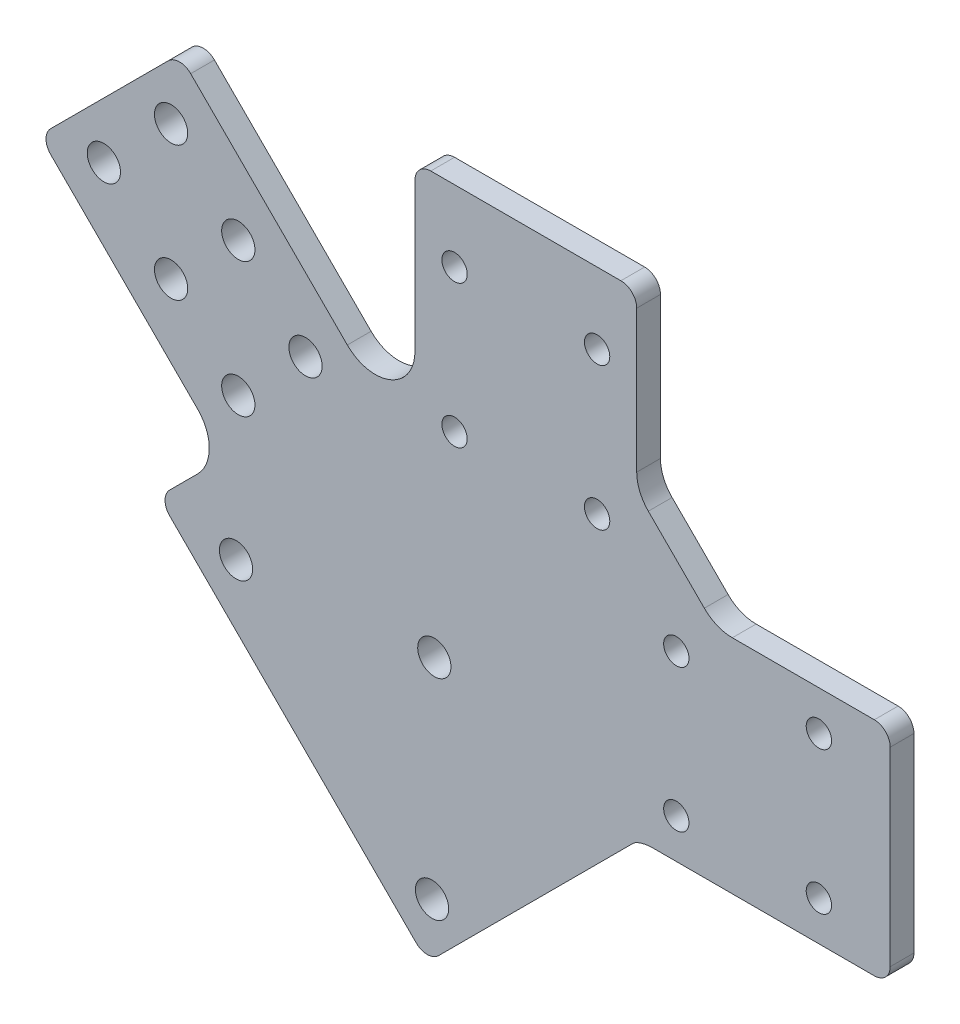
ISO-10303-21;
HEADER;
FILE_DESCRIPTION(('STEP AP214'),'2;1');
FILE_NAME('part.step','',(''),(''),'','','');
FILE_SCHEMA(('AUTOMOTIVE_DESIGN { 1 0 10303 214 1 1 1 1 }'));
ENDSEC;
DATA;
#1=APPLICATION_CONTEXT('core data for automotive mechanical design processes');
#2=APPLICATION_PROTOCOL_DEFINITION('international standard','automotive_design',2000,#1);
#3=PRODUCT_CONTEXT('',#1,'mechanical');
#4=PRODUCT('Part','Part','',(#3));
#5=PRODUCT_RELATED_PRODUCT_CATEGORY('part','',(#4));
#6=PRODUCT_DEFINITION_FORMATION('','',#4);
#7=PRODUCT_DEFINITION_CONTEXT('part definition',#1,'design');
#8=PRODUCT_DEFINITION('design','',#6,#7);
#9=PRODUCT_DEFINITION_SHAPE('','',#8);
#10=(LENGTH_UNIT() NAMED_UNIT(*) SI_UNIT(.MILLI.,.METRE.));
#11=(NAMED_UNIT(*) PLANE_ANGLE_UNIT() SI_UNIT($,.RADIAN.));
#12=(NAMED_UNIT(*) SI_UNIT($,.STERADIAN.) SOLID_ANGLE_UNIT());
#13=UNCERTAINTY_MEASURE_WITH_UNIT(LENGTH_MEASURE(1.E-05),#10,'distance_accuracy_value','');
#14=(GEOMETRIC_REPRESENTATION_CONTEXT(3) GLOBAL_UNCERTAINTY_ASSIGNED_CONTEXT((#13)) GLOBAL_UNIT_ASSIGNED_CONTEXT((#10,
#11,#12)) REPRESENTATION_CONTEXT('',''));
#15=CARTESIAN_POINT('',(0.,0.,0.));
#16=DIRECTION('',(0.,0.,1.));
#17=DIRECTION('',(1.,0.,0.));
#18=AXIS2_PLACEMENT_3D('',#15,#16,#17);
#19=CARTESIAN_POINT('',(0.,0.,3.));
#20=DIRECTION('',(0.,0.,-1.));
#21=DIRECTION('',(-1.,0.,0.));
#22=AXIS2_PLACEMENT_3D('',#19,#20,#21);
#23=PLANE('',#22);
#24=CARTESIAN_POINT('',(2.16177656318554,-19.537461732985,3.));
#25=DIRECTION('',(0.,0.,-1.));
#26=DIRECTION('',(-1.,0.,0.));
#27=AXIS2_PLACEMENT_3D('',#24,#25,#26);
#28=CIRCLE('',#27,2.1);
#29=CARTESIAN_POINT('',(0.0617765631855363,-19.537461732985,3.));
#30=VERTEX_POINT('',#29);
#31=EDGE_CURVE('E1064',#30,#30,#28,.T.);
#32=ORIENTED_EDGE('',*,*,#31,.T.);
#33=EDGE_LOOP('',(#32));
#34=FACE_BOUND('',#33,.T.);
#35=CARTESIAN_POINT('',(-22.5869607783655,5.21127560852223,3.));
#36=DIRECTION('',(0.,0.,-1.));
#37=DIRECTION('',(-1.,0.,0.));
#38=AXIS2_PLACEMENT_3D('',#35,#36,#37);
#39=CIRCLE('',#38,2.1);
#40=CARTESIAN_POINT('',(-24.6869607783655,5.21127560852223,3.));
#41=VERTEX_POINT('',#40);
#42=EDGE_CURVE('E1069',#41,#41,#39,.T.);
#43=ORIENTED_EDGE('',*,*,#42,.T.);
#44=EDGE_LOOP('',(#43));
#45=FACE_BOUND('',#44,.T.);
#46=CARTESIAN_POINT('',(2.44908921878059,7.04528329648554,3.));
#47=DIRECTION('',(0.,0.,-1.));
#48=DIRECTION('',(-1.,0.,0.));
#49=AXIS2_PLACEMENT_3D('',#46,#47,#48);
#50=CIRCLE('',#49,2.1);
#51=CARTESIAN_POINT('',(0.349089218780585,7.04528329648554,3.));
#52=VERTEX_POINT('',#51);
#53=EDGE_CURVE('E996',#52,#52,#50,.T.);
#54=ORIENTED_EDGE('',*,*,#53,.T.);
#55=EDGE_LOOP('',(#54));
#56=FACE_BOUND('',#55,.T.);
#57=DIRECTION('',(0.,1.,0.));
#58=VECTOR('',#57,1.);
#59=CARTESIAN_POINT('',(60.,28.,3.));
#60=LINE('',#59,#58);
#61=CARTESIAN_POINT('',(60.,2.,3.));
#62=VERTEX_POINT('',#61);
#63=CARTESIAN_POINT('',(60.,26.,3.));
#64=VERTEX_POINT('',#63);
#65=EDGE_CURVE('E453',#62,#64,#60,.T.);
#66=ORIENTED_EDGE('',*,*,#65,.T.);
#67=CARTESIAN_POINT('',(58.,26.,3.));
#68=DIRECTION('',(0.,0.,-1.));
#69=DIRECTION('',(-1.,0.,0.));
#70=AXIS2_PLACEMENT_3D('',#67,#68,#69);
#71=CIRCLE('',#70,2.);
#72=CARTESIAN_POINT('',(58.,28.,3.));
#73=VERTEX_POINT('',#72);
#74=EDGE_CURVE('E323',#64,#73,#71,.F.);
#75=ORIENTED_EDGE('',*,*,#74,.T.);
#76=DIRECTION('',(-1.,0.,0.));
#77=VECTOR('',#76,1.);
#78=CARTESIAN_POINT('',(28.,28.,3.));
#79=LINE('',#78,#77);
#80=CARTESIAN_POINT('',(40.0710678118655,28.,3.));
#81=VERTEX_POINT('',#80);
#82=EDGE_CURVE('E456',#73,#81,#79,.T.);
#83=ORIENTED_EDGE('',*,*,#82,.T.);
#84=CARTESIAN_POINT('',(40.0710678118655,33.,3.));
#85=DIRECTION('',(0.,0.,-1.));
#86=DIRECTION('',(-1.,0.,0.));
#87=AXIS2_PLACEMENT_3D('',#84,#85,#86);
#88=CIRCLE('',#87,5.);
#89=CARTESIAN_POINT('',(36.5355339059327,29.4644660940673,3.));
#90=VERTEX_POINT('',#89);
#91=EDGE_CURVE('E277',#81,#90,#88,.T.);
#92=ORIENTED_EDGE('',*,*,#91,.T.);
#93=DIRECTION('',(0.707106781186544,-0.707106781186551,0.));
#94=VECTOR('',#93,1.);
#95=CARTESIAN_POINT('',(33.0000000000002,32.9999999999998,3.));
#96=LINE('',#95,#94);
#97=CARTESIAN_POINT('',(29.4644660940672,36.5355339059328,3.));
#98=VERTEX_POINT('',#97);
#99=EDGE_CURVE('E242',#90,#98,#96,.F.);
#100=ORIENTED_EDGE('',*,*,#99,.T.);
#101=CARTESIAN_POINT('',(33.,40.0710678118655,3.));
#102=DIRECTION('',(0.,0.,-1.));
#103=DIRECTION('',(-1.,0.,0.));
#104=AXIS2_PLACEMENT_3D('',#101,#102,#103);
#105=CIRCLE('',#104,5.);
#106=CARTESIAN_POINT('',(28.,40.0710678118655,3.));
#107=VERTEX_POINT('',#106);
#108=EDGE_CURVE('E275',#98,#107,#105,.T.);
#109=ORIENTED_EDGE('',*,*,#108,.T.);
#110=DIRECTION('',(0.,1.,0.));
#111=VECTOR('',#110,1.);
#112=CARTESIAN_POINT('',(28.,60.,3.));
#113=LINE('',#112,#111);
#114=CARTESIAN_POINT('',(28.,58.,3.));
#115=VERTEX_POINT('',#114);
#116=EDGE_CURVE('E458',#107,#115,#113,.T.);
#117=ORIENTED_EDGE('',*,*,#116,.T.);
#118=CARTESIAN_POINT('',(26.,58.,3.));
#119=DIRECTION('',(0.,0.,-1.));
#120=DIRECTION('',(-1.,0.,0.));
#121=AXIS2_PLACEMENT_3D('',#118,#119,#120);
#122=CIRCLE('',#121,2.);
#123=CARTESIAN_POINT('',(26.,60.,3.));
#124=VERTEX_POINT('',#123);
#125=EDGE_CURVE('E58',#115,#124,#122,.F.);
#126=ORIENTED_EDGE('',*,*,#125,.T.);
#127=DIRECTION('',(-1.,0.,0.));
#128=VECTOR('',#127,1.);
#129=CARTESIAN_POINT('',(0.,60.,3.));
#130=LINE('',#129,#128);
#131=CARTESIAN_POINT('',(2.,60.,3.));
#132=VERTEX_POINT('',#131);
#133=EDGE_CURVE('E460',#124,#132,#130,.T.);
#134=ORIENTED_EDGE('',*,*,#133,.T.);
#135=CARTESIAN_POINT('',(2.,58.,3.));
#136=DIRECTION('',(0.,0.,-1.));
#137=DIRECTION('',(-1.,0.,0.));
#138=AXIS2_PLACEMENT_3D('',#135,#136,#137);
#139=CIRCLE('',#138,2.);
#140=CARTESIAN_POINT('',(0.,58.,3.));
#141=VERTEX_POINT('',#140);
#142=EDGE_CURVE('E311',#132,#141,#139,.F.);
#143=ORIENTED_EDGE('',*,*,#142,.T.);
#144=DIRECTION('',(0.,-1.,0.));
#145=VECTOR('',#144,1.);
#146=CARTESIAN_POINT('',(0.,0.,3.));
#147=LINE('',#146,#145);
#148=CARTESIAN_POINT('',(0.,39.2431098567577,3.));
#149=VERTEX_POINT('',#148);
#150=EDGE_CURVE('E462',#141,#149,#147,.T.);
#151=ORIENTED_EDGE('',*,*,#150,.T.);
#152=CARTESIAN_POINT('',(-5.,39.2431098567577,3.));
#153=DIRECTION('',(0.,0.,-1.));
#154=DIRECTION('',(-1.,0.,0.));
#155=AXIS2_PLACEMENT_3D('',#152,#153,#154);
#156=CIRCLE('',#155,5.);
#157=CARTESIAN_POINT('',(-8.53553390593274,35.707575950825,3.));
#158=VERTEX_POINT('',#157);
#159=EDGE_CURVE('E282',#149,#158,#156,.T.);
#160=ORIENTED_EDGE('',*,*,#159,.T.);
#161=DIRECTION('',(-0.707106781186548,0.707106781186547,0.));
#162=VECTOR('',#161,1.);
#163=CARTESIAN_POINT('',(13.5860210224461,13.5860210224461,3.));
#164=LINE('',#163,#162);
#165=CARTESIAN_POINT('',(-28.3100557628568,55.4820978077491,3.));
#166=VERTEX_POINT('',#165);
#167=EDGE_CURVE('E398',#158,#166,#164,.T.);
#168=ORIENTED_EDGE('',*,*,#167,.T.);
#169=CARTESIAN_POINT('',(-29.7242693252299,54.067884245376,3.));
#170=DIRECTION('',(0.,0.,-1.));
#171=DIRECTION('',(-1.,0.,0.));
#172=AXIS2_PLACEMENT_3D('',#169,#170,#171);
#173=CIRCLE('',#172,2.);
#174=CARTESIAN_POINT('',(-31.138482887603,55.4820978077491,3.));
#175=VERTEX_POINT('',#174);
#176=EDGE_CURVE('E314',#166,#175,#173,.F.);
#177=ORIENTED_EDGE('',*,*,#176,.T.);
#178=DIRECTION('',(-0.707106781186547,-0.707106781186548,0.));
#179=VECTOR('',#178,1.);
#180=CARTESIAN_POINT('',(-47.4019388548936,39.2186418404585,3.));
#181=LINE('',#180,#179);
#182=CARTESIAN_POINT('',(-45.9877252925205,40.6328554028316,3.));
#183=VERTEX_POINT('',#182);
#184=EDGE_CURVE('E227',#175,#183,#181,.T.);
#185=ORIENTED_EDGE('',*,*,#184,.T.);
#186=CARTESIAN_POINT('',(-44.5735117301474,39.2186418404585,3.));
#187=DIRECTION('',(0.,0.,-1.));
#188=DIRECTION('',(-1.,0.,0.));
#189=AXIS2_PLACEMENT_3D('',#186,#187,#188);
#190=CIRCLE('',#189,2.);
#191=CARTESIAN_POINT('',(-45.9877252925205,37.8044282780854,3.));
#192=VERTEX_POINT('',#191);
#193=EDGE_CURVE('E222',#183,#192,#190,.F.);
#194=ORIENTED_EDGE('',*,*,#193,.T.);
#195=DIRECTION('',(0.707106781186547,-0.707106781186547,0.));
#196=VECTOR('',#195,1.);
#197=CARTESIAN_POINT('',(-4.09164850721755,-4.09164850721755,3.));
#198=LINE('',#197,#196);
#199=CARTESIAN_POINT('',(-27.4261722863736,19.2428752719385,3.));
#200=VERTEX_POINT('',#199);
#201=EDGE_CURVE('E214',#192,#200,#198,.T.);
#202=ORIENTED_EDGE('',*,*,#201,.T.);
#203=CARTESIAN_POINT('',(-30.9617061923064,15.7073413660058,3.));
#204=DIRECTION('',(0.,0.,-1.));
#205=DIRECTION('',(-1.,0.,0.));
#206=AXIS2_PLACEMENT_3D('',#203,#204,#205);
#207=CIRCLE('',#206,5.);
#208=CARTESIAN_POINT('',(-27.4261722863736,12.171807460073,3.));
#209=VERTEX_POINT('',#208);
#210=EDGE_CURVE('E219',#200,#209,#207,.T.);
#211=ORIENTED_EDGE('',*,*,#210,.T.);
#212=DIRECTION('',(-0.707106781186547,-0.707106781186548,0.));
#213=VECTOR('',#212,1.);
#214=CARTESIAN_POINT('',(-32.3759197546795,7.2220599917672,3.));
#215=LINE('',#214,#213);
#216=CARTESIAN_POINT('',(-30.9617061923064,8.63627355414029,3.));
#217=VERTEX_POINT('',#216);
#218=EDGE_CURVE('E990',#209,#217,#215,.T.);
#219=ORIENTED_EDGE('',*,*,#218,.T.);
#220=CARTESIAN_POINT('',(-29.5474926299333,7.2220599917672,3.));
#221=DIRECTION('',(0.,0.,-1.));
#222=DIRECTION('',(-1.,0.,0.));
#223=AXIS2_PLACEMENT_3D('',#220,#221,#222);
#224=CIRCLE('',#223,2.);
#225=CARTESIAN_POINT('',(-30.9617061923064,5.8078464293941,3.));
#226=VERTEX_POINT('',#225);
#227=EDGE_CURVE('E317',#217,#226,#224,.F.);
#228=ORIENTED_EDGE('',*,*,#227,.T.);
#229=DIRECTION('',(0.707106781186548,-0.707106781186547,0.));
#230=VECTOR('',#229,1.);
#231=CARTESIAN_POINT('',(1.56520574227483,-26.7190655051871,3.));
#232=LINE('',#231,#230);
#233=CARTESIAN_POINT('',(0.150992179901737,-25.304851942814,3.));
#234=VERTEX_POINT('',#233);
#235=EDGE_CURVE('E984',#226,#234,#232,.T.);
#236=ORIENTED_EDGE('',*,*,#235,.T.);
#237=CARTESIAN_POINT('',(1.56520574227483,-23.8906383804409,3.));
#238=DIRECTION('',(0.,0.,-1.));
#239=DIRECTION('',(-1.,0.,0.));
#240=AXIS2_PLACEMENT_3D('',#237,#238,#239);
#241=CIRCLE('',#240,2.);
#242=CARTESIAN_POINT('',(2.97941930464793,-25.304851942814,3.));
#243=VERTEX_POINT('',#242);
#244=EDGE_CURVE('E319',#234,#243,#241,.F.);
#245=ORIENTED_EDGE('',*,*,#244,.T.);
#246=DIRECTION('',(0.707106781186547,0.707106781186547,0.));
#247=VECTOR('',#246,1.);
#248=CARTESIAN_POINT('',(27.7281566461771,-0.556114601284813,3.));
#249=LINE('',#248,#247);
#250=CARTESIAN_POINT('',(27.4788227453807,-0.805448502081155,3.));
#251=VERTEX_POINT('',#250);
#252=EDGE_CURVE('E365',#243,#251,#249,.T.);
#253=ORIENTED_EDGE('',*,*,#252,.T.);
#254=CARTESIAN_POINT('',(28.8930363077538,-2.21966206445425,3.));
#255=DIRECTION('',(0.,0.,-1.));
#256=DIRECTION('',(-1.,0.,0.));
#257=AXIS2_PLACEMENT_3D('',#254,#255,#256);
#258=CIRCLE('',#257,2.);
#259=CARTESIAN_POINT('',(28.1418236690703,-0.366103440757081,3.));
#260=VERTEX_POINT('',#259);
#261=EDGE_CURVE('E44',#251,#260,#258,.T.);
#262=ORIENTED_EDGE('',*,*,#261,.T.);
#263=CARTESIAN_POINT('',(30.0198552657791,-5.,3.));
#264=DIRECTION('',(0.,0.,-1.));
#265=DIRECTION('',(-1.,0.,0.));
#266=AXIS2_PLACEMENT_3D('',#263,#264,#265);
#267=CIRCLE('',#266,5.);
#268=CARTESIAN_POINT('',(30.0198552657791,0.,3.));
#269=VERTEX_POINT('',#268);
#270=EDGE_CURVE('E271',#260,#269,#267,.T.);
#271=ORIENTED_EDGE('',*,*,#270,.T.);
#272=DIRECTION('',(1.,0.,0.));
#273=VECTOR('',#272,1.);
#274=CARTESIAN_POINT('',(0.,0.,3.));
#275=LINE('',#274,#273);
#276=CARTESIAN_POINT('',(58.,0.,3.));
#277=VERTEX_POINT('',#276);
#278=EDGE_CURVE('E451',#269,#277,#275,.T.);
#279=ORIENTED_EDGE('',*,*,#278,.T.);
#280=CARTESIAN_POINT('',(58.,2.,3.));
#281=DIRECTION('',(0.,0.,-1.));
#282=DIRECTION('',(-1.,0.,0.));
#283=AXIS2_PLACEMENT_3D('',#280,#281,#282);
#284=CIRCLE('',#283,2.);
#285=EDGE_CURVE('E321',#277,#62,#284,.F.);
#286=ORIENTED_EDGE('',*,*,#285,.T.);
#287=EDGE_LOOP('',(#66,#75,#83,#92,#100,#109,#117,#126,#134,#143,#151,#160,#168,#177,#185,#194,
#202,#211,#219,#228,#236,#245,#253,#262,#271,#279,#286));
#288=FACE_BOUND('',#287,.T.);
#289=CARTESIAN_POINT('',(23.,51.,3.));
#290=DIRECTION('',(0.,0.,1.));
#291=DIRECTION('',(1.,0.,0.));
#292=AXIS2_PLACEMENT_3D('',#289,#290,#291);
#293=CIRCLE('',#292,1.60000000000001);
#294=CARTESIAN_POINT('',(24.6,51.,3.));
#295=VERTEX_POINT('',#294);
#296=EDGE_CURVE('E445',#295,#295,#293,.T.);
#297=ORIENTED_EDGE('',*,*,#296,.F.);
#298=EDGE_LOOP('',(#297));
#299=FACE_BOUND('',#298,.T.);
#300=CARTESIAN_POINT('',(5.,51.,3.));
#301=DIRECTION('',(0.,0.,1.));
#302=DIRECTION('',(1.,0.,0.));
#303=AXIS2_PLACEMENT_3D('',#300,#301,#302);
#304=CIRCLE('',#303,1.6);
#305=CARTESIAN_POINT('',(6.59999999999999,51.,3.));
#306=VERTEX_POINT('',#305);
#307=EDGE_CURVE('E439',#306,#306,#304,.T.);
#308=ORIENTED_EDGE('',*,*,#307,.F.);
#309=EDGE_LOOP('',(#308));
#310=FACE_BOUND('',#309,.T.);
#311=CARTESIAN_POINT('',(23.,33.,3.));
#312=DIRECTION('',(0.,0.,1.));
#313=DIRECTION('',(1.,0.,0.));
#314=AXIS2_PLACEMENT_3D('',#311,#312,#313);
#315=CIRCLE('',#314,1.6);
#316=CARTESIAN_POINT('',(24.6,33.,3.));
#317=VERTEX_POINT('',#316);
#318=EDGE_CURVE('E433',#317,#317,#315,.T.);
#319=ORIENTED_EDGE('',*,*,#318,.F.);
#320=EDGE_LOOP('',(#319));
#321=FACE_BOUND('',#320,.T.);
#322=CARTESIAN_POINT('',(5.,33.,3.));
#323=DIRECTION('',(0.,0.,1.));
#324=DIRECTION('',(1.,0.,0.));
#325=AXIS2_PLACEMENT_3D('',#322,#323,#324);
#326=CIRCLE('',#325,1.6);
#327=CARTESIAN_POINT('',(6.59999999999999,33.,3.));
#328=VERTEX_POINT('',#327);
#329=EDGE_CURVE('E427',#328,#328,#326,.T.);
#330=ORIENTED_EDGE('',*,*,#329,.F.);
#331=EDGE_LOOP('',(#330));
#332=FACE_BOUND('',#331,.T.);
#333=CARTESIAN_POINT('',(51.,23.,3.));
#334=DIRECTION('',(0.,0.,1.));
#335=DIRECTION('',(1.,0.,0.));
#336=AXIS2_PLACEMENT_3D('',#333,#334,#335);
#337=CIRCLE('',#336,1.6);
#338=CARTESIAN_POINT('',(52.6,23.,3.));
#339=VERTEX_POINT('',#338);
#340=EDGE_CURVE('E421',#339,#339,#337,.T.);
#341=ORIENTED_EDGE('',*,*,#340,.F.);
#342=EDGE_LOOP('',(#341));
#343=FACE_BOUND('',#342,.T.);
#344=CARTESIAN_POINT('',(51.,4.99999999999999,3.));
#345=DIRECTION('',(0.,0.,1.));
#346=DIRECTION('',(1.,0.,0.));
#347=AXIS2_PLACEMENT_3D('',#344,#345,#346);
#348=CIRCLE('',#347,1.60000000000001);
#349=CARTESIAN_POINT('',(52.6,4.99999999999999,3.));
#350=VERTEX_POINT('',#349);
#351=EDGE_CURVE('E415',#350,#350,#348,.T.);
#352=ORIENTED_EDGE('',*,*,#351,.F.);
#353=EDGE_LOOP('',(#352));
#354=FACE_BOUND('',#353,.T.);
#355=CARTESIAN_POINT('',(33.,4.99999999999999,3.));
#356=DIRECTION('',(0.,0.,1.));
#357=DIRECTION('',(1.,0.,0.));
#358=AXIS2_PLACEMENT_3D('',#355,#356,#357);
#359=CIRCLE('',#358,1.6);
#360=CARTESIAN_POINT('',(34.6,4.99999999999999,3.));
#361=VERTEX_POINT('',#360);
#362=EDGE_CURVE('E409',#361,#361,#359,.T.);
#363=ORIENTED_EDGE('',*,*,#362,.F.);
#364=EDGE_LOOP('',(#363));
#365=FACE_BOUND('',#364,.T.);
#366=CARTESIAN_POINT('',(33.,23.,3.));
#367=DIRECTION('',(0.,0.,1.));
#368=DIRECTION('',(1.,0.,0.));
#369=AXIS2_PLACEMENT_3D('',#366,#367,#368);
#370=CIRCLE('',#369,1.6);
#371=CARTESIAN_POINT('',(34.6,23.,3.));
#372=VERTEX_POINT('',#371);
#373=EDGE_CURVE('E403',#372,#372,#370,.T.);
#374=ORIENTED_EDGE('',*,*,#373,.F.);
#375=EDGE_LOOP('',(#374));
#376=FACE_BOUND('',#375,.T.);
#377=CARTESIAN_POINT('',(-30.7849294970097,48.7645833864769,3.));
#378=DIRECTION('',(0.,0.,1.));
#379=DIRECTION('',(1.,0.,0.));
#380=AXIS2_PLACEMENT_3D('',#377,#378,#379);
#381=CIRCLE('',#380,2.1);
#382=CARTESIAN_POINT('',(-28.6849294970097,48.7645833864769,3.));
#383=VERTEX_POINT('',#382);
#384=EDGE_CURVE('E987',#383,#383,#381,.T.);
#385=ORIENTED_EDGE('',*,*,#384,.F.);
#386=EDGE_LOOP('',(#385));
#387=FACE_BOUND('',#386,.T.);
#388=CARTESIAN_POINT('',(-22.2996481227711,40.2793020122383,3.));
#389=DIRECTION('',(0.,0.,1.));
#390=DIRECTION('',(1.,0.,0.));
#391=AXIS2_PLACEMENT_3D('',#388,#389,#390);
#392=CIRCLE('',#391,2.1);
#393=CARTESIAN_POINT('',(-20.1996481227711,40.2793020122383,3.));
#394=VERTEX_POINT('',#393);
#395=EDGE_CURVE('E1001',#394,#394,#392,.T.);
#396=ORIENTED_EDGE('',*,*,#395,.F.);
#397=EDGE_LOOP('',(#396));
#398=FACE_BOUND('',#397,.T.);
#399=CARTESIAN_POINT('',(-39.2702108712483,40.2793020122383,3.));
#400=DIRECTION('',(0.,0.,1.));
#401=DIRECTION('',(1.,0.,0.));
#402=AXIS2_PLACEMENT_3D('',#399,#400,#401);
#403=CIRCLE('',#402,2.1);
#404=CARTESIAN_POINT('',(-37.1702108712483,40.2793020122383,3.));
#405=VERTEX_POINT('',#404);
#406=EDGE_CURVE('E1007',#405,#405,#403,.T.);
#407=ORIENTED_EDGE('',*,*,#406,.F.);
#408=EDGE_LOOP('',(#407));
#409=FACE_BOUND('',#408,.T.);
#410=CARTESIAN_POINT('',(-30.7849294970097,31.7940206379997,3.));
#411=DIRECTION('',(0.,0.,1.));
#412=DIRECTION('',(1.,0.,0.));
#413=AXIS2_PLACEMENT_3D('',#410,#411,#412);
#414=CIRCLE('',#413,2.1);
#415=CARTESIAN_POINT('',(-28.6849294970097,31.7940206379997,3.));
#416=VERTEX_POINT('',#415);
#417=EDGE_CURVE('E1013',#416,#416,#414,.T.);
#418=ORIENTED_EDGE('',*,*,#417,.F.);
#419=EDGE_LOOP('',(#418));
#420=FACE_BOUND('',#419,.T.);
#421=CARTESIAN_POINT('',(-13.8143667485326,31.7940206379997,3.));
#422=DIRECTION('',(0.,0.,1.));
#423=DIRECTION('',(1.,0.,0.));
#424=AXIS2_PLACEMENT_3D('',#421,#422,#423);
#425=CIRCLE('',#424,2.1);
#426=CARTESIAN_POINT('',(-11.7143667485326,31.7940206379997,3.));
#427=VERTEX_POINT('',#426);
#428=EDGE_CURVE('E1019',#427,#427,#425,.T.);
#429=ORIENTED_EDGE('',*,*,#428,.F.);
#430=EDGE_LOOP('',(#429));
#431=FACE_BOUND('',#430,.T.);
#432=CARTESIAN_POINT('',(-22.2996481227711,23.3087392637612,3.));
#433=DIRECTION('',(0.,0.,1.));
#434=DIRECTION('',(1.,0.,0.));
#435=AXIS2_PLACEMENT_3D('',#432,#433,#434);
#436=CIRCLE('',#435,2.1);
#437=CARTESIAN_POINT('',(-20.1996481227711,23.3087392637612,3.));
#438=VERTEX_POINT('',#437);
#439=EDGE_CURVE('E1025',#438,#438,#436,.T.);
#440=ORIENTED_EDGE('',*,*,#439,.F.);
#441=EDGE_LOOP('',(#440));
#442=FACE_BOUND('',#441,.T.);
#443=ADVANCED_FACE('F36',(#34,#45,#56,#288,#299,#310,#321,#332,#343,#354,#365,#376,#387,#398,
#409,#420,#431,#442),#23,.F.);
#444=CARTESIAN_POINT('',(0.,0.,0.));
#445=DIRECTION('',(0.,0.,-1.));
#446=DIRECTION('',(-1.,0.,0.));
#447=AXIS2_PLACEMENT_3D('',#444,#445,#446);
#448=PLANE('',#447);
#449=CARTESIAN_POINT('',(2.16177656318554,-19.537461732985,0.));
#450=DIRECTION('',(0.,0.,-1.));
#451=DIRECTION('',(-1.,0.,0.));
#452=AXIS2_PLACEMENT_3D('',#449,#450,#451);
#453=CIRCLE('',#452,2.1);
#454=CARTESIAN_POINT('',(0.0617765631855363,-19.537461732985,0.));
#455=VERTEX_POINT('',#454);
#456=EDGE_CURVE('E1072',#455,#455,#453,.T.);
#457=ORIENTED_EDGE('',*,*,#456,.F.);
#458=EDGE_LOOP('',(#457));
#459=FACE_BOUND('',#458,.T.);
#460=CARTESIAN_POINT('',(-22.5869607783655,5.21127560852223,0.));
#461=DIRECTION('',(0.,0.,-1.));
#462=DIRECTION('',(-1.,0.,0.));
#463=AXIS2_PLACEMENT_3D('',#460,#461,#462);
#464=CIRCLE('',#463,2.1);
#465=CARTESIAN_POINT('',(-24.6869607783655,5.21127560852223,0.));
#466=VERTEX_POINT('',#465);
#467=EDGE_CURVE('E1066',#466,#466,#464,.T.);
#468=ORIENTED_EDGE('',*,*,#467,.F.);
#469=EDGE_LOOP('',(#468));
#470=FACE_BOUND('',#469,.T.);
#471=CARTESIAN_POINT('',(2.44908921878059,7.04528329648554,0.));
#472=DIRECTION('',(0.,0.,-1.));
#473=DIRECTION('',(-1.,0.,0.));
#474=AXIS2_PLACEMENT_3D('',#471,#472,#473);
#475=CIRCLE('',#474,2.1);
#476=CARTESIAN_POINT('',(0.349089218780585,7.04528329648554,0.));
#477=VERTEX_POINT('',#476);
#478=EDGE_CURVE('E993',#477,#477,#475,.T.);
#479=ORIENTED_EDGE('',*,*,#478,.F.);
#480=EDGE_LOOP('',(#479));
#481=FACE_BOUND('',#480,.T.);
#482=DIRECTION('',(-1.,0.,0.));
#483=VECTOR('',#482,1.);
#484=CARTESIAN_POINT('',(28.,28.,0.));
#485=LINE('',#484,#483);
#486=CARTESIAN_POINT('',(58.,28.,0.));
#487=VERTEX_POINT('',#486);
#488=CARTESIAN_POINT('',(40.0710678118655,28.,0.));
#489=VERTEX_POINT('',#488);
#490=EDGE_CURVE('E469',#487,#489,#485,.T.);
#491=ORIENTED_EDGE('',*,*,#490,.F.);
#492=CARTESIAN_POINT('',(58.,26.,0.));
#493=DIRECTION('',(0.,0.,-1.));
#494=DIRECTION('',(-1.,0.,0.));
#495=AXIS2_PLACEMENT_3D('',#492,#493,#494);
#496=CIRCLE('',#495,2.);
#497=CARTESIAN_POINT('',(60.,26.,0.));
#498=VERTEX_POINT('',#497);
#499=EDGE_CURVE('E304',#487,#498,#496,.T.);
#500=ORIENTED_EDGE('',*,*,#499,.T.);
#501=DIRECTION('',(0.,1.,0.));
#502=VECTOR('',#501,1.);
#503=CARTESIAN_POINT('',(60.,28.,0.));
#504=LINE('',#503,#502);
#505=CARTESIAN_POINT('',(60.,2.,0.));
#506=VERTEX_POINT('',#505);
#507=EDGE_CURVE('E466',#506,#498,#504,.T.);
#508=ORIENTED_EDGE('',*,*,#507,.F.);
#509=CARTESIAN_POINT('',(58.,2.,0.));
#510=DIRECTION('',(0.,0.,-1.));
#511=DIRECTION('',(-1.,0.,0.));
#512=AXIS2_PLACEMENT_3D('',#509,#510,#511);
#513=CIRCLE('',#512,2.);
#514=CARTESIAN_POINT('',(58.,0.,0.));
#515=VERTEX_POINT('',#514);
#516=EDGE_CURVE('E302',#506,#515,#513,.T.);
#517=ORIENTED_EDGE('',*,*,#516,.T.);
#518=DIRECTION('',(1.,0.,0.));
#519=VECTOR('',#518,1.);
#520=CARTESIAN_POINT('',(0.,0.,0.));
#521=LINE('',#520,#519);
#522=CARTESIAN_POINT('',(30.0198552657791,0.,0.));
#523=VERTEX_POINT('',#522);
#524=EDGE_CURVE('E448',#523,#515,#521,.T.);
#525=ORIENTED_EDGE('',*,*,#524,.F.);
#526=CARTESIAN_POINT('',(30.0198552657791,-5.,0.));
#527=DIRECTION('',(0.,0.,-1.));
#528=DIRECTION('',(-1.,0.,0.));
#529=AXIS2_PLACEMENT_3D('',#526,#527,#528);
#530=CIRCLE('',#529,5.);
#531=CARTESIAN_POINT('',(28.1418236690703,-0.366103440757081,0.));
#532=VERTEX_POINT('',#531);
#533=EDGE_CURVE('E268',#523,#532,#530,.F.);
#534=ORIENTED_EDGE('',*,*,#533,.T.);
#535=CARTESIAN_POINT('',(28.8930363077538,-2.21966206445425,0.));
#536=DIRECTION('',(0.,0.,-1.));
#537=DIRECTION('',(-1.,0.,0.));
#538=AXIS2_PLACEMENT_3D('',#535,#536,#537);
#539=CIRCLE('',#538,2.);
#540=CARTESIAN_POINT('',(27.4788227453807,-0.805448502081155,0.));
#541=VERTEX_POINT('',#540);
#542=EDGE_CURVE('E11',#532,#541,#539,.F.);
#543=ORIENTED_EDGE('',*,*,#542,.T.);
#544=DIRECTION('',(0.707106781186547,0.707106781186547,0.));
#545=VECTOR('',#544,1.);
#546=CARTESIAN_POINT('',(27.7281566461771,-0.556114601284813,0.));
#547=LINE('',#546,#545);
#548=CARTESIAN_POINT('',(2.97941930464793,-25.304851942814,0.));
#549=VERTEX_POINT('',#548);
#550=EDGE_CURVE('E380',#549,#541,#547,.T.);
#551=ORIENTED_EDGE('',*,*,#550,.F.);
#552=CARTESIAN_POINT('',(1.56520574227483,-23.8906383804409,0.));
#553=DIRECTION('',(0.,0.,-1.));
#554=DIRECTION('',(-1.,0.,0.));
#555=AXIS2_PLACEMENT_3D('',#552,#553,#554);
#556=CIRCLE('',#555,2.);
#557=CARTESIAN_POINT('',(0.150992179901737,-25.304851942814,0.));
#558=VERTEX_POINT('',#557);
#559=EDGE_CURVE('E300',#549,#558,#556,.T.);
#560=ORIENTED_EDGE('',*,*,#559,.T.);
#561=DIRECTION('',(0.707106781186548,-0.707106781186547,0.));
#562=VECTOR('',#561,1.);
#563=CARTESIAN_POINT('',(1.56520574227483,-26.7190655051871,0.));
#564=LINE('',#563,#562);
#565=CARTESIAN_POINT('',(-30.9617061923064,5.8078464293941,0.));
#566=VERTEX_POINT('',#565);
#567=EDGE_CURVE('E983',#566,#558,#564,.T.);
#568=ORIENTED_EDGE('',*,*,#567,.F.);
#569=CARTESIAN_POINT('',(-29.5474926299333,7.2220599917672,0.));
#570=DIRECTION('',(0.,0.,-1.));
#571=DIRECTION('',(-1.,0.,0.));
#572=AXIS2_PLACEMENT_3D('',#569,#570,#571);
#573=CIRCLE('',#572,2.);
#574=CARTESIAN_POINT('',(-30.9617061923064,8.63627355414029,0.));
#575=VERTEX_POINT('',#574);
#576=EDGE_CURVE('E298',#566,#575,#573,.T.);
#577=ORIENTED_EDGE('',*,*,#576,.T.);
#578=DIRECTION('',(-0.707106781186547,-0.707106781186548,0.));
#579=VECTOR('',#578,1.);
#580=CARTESIAN_POINT('',(-32.3759197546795,7.2220599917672,0.));
#581=LINE('',#580,#579);
#582=CARTESIAN_POINT('',(-27.4261722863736,12.171807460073,0.));
#583=VERTEX_POINT('',#582);
#584=EDGE_CURVE('E979',#583,#575,#581,.T.);
#585=ORIENTED_EDGE('',*,*,#584,.F.);
#586=CARTESIAN_POINT('',(-30.9617061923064,15.7073413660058,0.));
#587=DIRECTION('',(0.,0.,-1.));
#588=DIRECTION('',(-1.,0.,0.));
#589=AXIS2_PLACEMENT_3D('',#586,#587,#588);
#590=CIRCLE('',#589,5.);
#591=CARTESIAN_POINT('',(-27.4261722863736,19.2428752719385,0.));
#592=VERTEX_POINT('',#591);
#593=EDGE_CURVE('E236',#583,#592,#590,.F.);
#594=ORIENTED_EDGE('',*,*,#593,.T.);
#595=DIRECTION('',(0.707106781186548,-0.707106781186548,0.));
#596=VECTOR('',#595,1.);
#597=CARTESIAN_POINT('',(10.0504871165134,-18.2337841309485,0.));
#598=LINE('',#597,#596);
#599=CARTESIAN_POINT('',(-45.9877252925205,37.8044282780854,0.));
#600=VERTEX_POINT('',#599);
#601=EDGE_CURVE('E226',#600,#592,#598,.T.);
#602=ORIENTED_EDGE('',*,*,#601,.F.);
#603=CARTESIAN_POINT('',(-44.5735117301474,39.2186418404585,0.));
#604=DIRECTION('',(0.,0.,-1.));
#605=DIRECTION('',(-1.,0.,0.));
#606=AXIS2_PLACEMENT_3D('',#603,#604,#605);
#607=CIRCLE('',#606,2.);
#608=CARTESIAN_POINT('',(-45.9877252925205,40.6328554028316,0.));
#609=VERTEX_POINT('',#608);
#610=EDGE_CURVE('E296',#600,#609,#607,.T.);
#611=ORIENTED_EDGE('',*,*,#610,.T.);
#612=DIRECTION('',(-0.707106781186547,-0.707106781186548,0.));
#613=VECTOR('',#612,1.);
#614=CARTESIAN_POINT('',(-47.4019388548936,39.2186418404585,0.));
#615=LINE('',#614,#613);
#616=CARTESIAN_POINT('',(-31.138482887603,55.4820978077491,0.));
#617=VERTEX_POINT('',#616);
#618=EDGE_CURVE('E389',#617,#609,#615,.T.);
#619=ORIENTED_EDGE('',*,*,#618,.F.);
#620=CARTESIAN_POINT('',(-29.7242693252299,54.067884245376,0.));
#621=DIRECTION('',(0.,0.,-1.));
#622=DIRECTION('',(-1.,0.,0.));
#623=AXIS2_PLACEMENT_3D('',#620,#621,#622);
#624=CIRCLE('',#623,2.);
#625=CARTESIAN_POINT('',(-28.3100557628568,55.4820978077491,0.));
#626=VERTEX_POINT('',#625);
#627=EDGE_CURVE('E294',#617,#626,#624,.T.);
#628=ORIENTED_EDGE('',*,*,#627,.T.);
#629=DIRECTION('',(-0.707106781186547,0.707106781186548,0.));
#630=VECTOR('',#629,1.);
#631=CARTESIAN_POINT('',(13.5860210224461,13.5860210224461,0.));
#632=LINE('',#631,#630);
#633=CARTESIAN_POINT('',(-8.53553390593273,35.707575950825,0.));
#634=VERTEX_POINT('',#633);
#635=EDGE_CURVE('E386',#634,#626,#632,.T.);
#636=ORIENTED_EDGE('',*,*,#635,.F.);
#637=CARTESIAN_POINT('',(-5.,39.2431098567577,0.));
#638=DIRECTION('',(0.,0.,-1.));
#639=DIRECTION('',(-1.,0.,0.));
#640=AXIS2_PLACEMENT_3D('',#637,#638,#639);
#641=CIRCLE('',#640,5.);
#642=CARTESIAN_POINT('',(0.,39.2431098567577,0.));
#643=VERTEX_POINT('',#642);
#644=EDGE_CURVE('E284',#634,#643,#641,.F.);
#645=ORIENTED_EDGE('',*,*,#644,.T.);
#646=DIRECTION('',(0.,-1.,0.));
#647=VECTOR('',#646,1.);
#648=CARTESIAN_POINT('',(0.,0.,0.));
#649=LINE('',#648,#647);
#650=CARTESIAN_POINT('',(0.,58.,0.));
#651=VERTEX_POINT('',#650);
#652=EDGE_CURVE('E454',#651,#643,#649,.T.);
#653=ORIENTED_EDGE('',*,*,#652,.F.);
#654=CARTESIAN_POINT('',(2.,58.,0.));
#655=DIRECTION('',(0.,0.,-1.));
#656=DIRECTION('',(-1.,0.,0.));
#657=AXIS2_PLACEMENT_3D('',#654,#655,#656);
#658=CIRCLE('',#657,2.);
#659=CARTESIAN_POINT('',(2.,60.,0.));
#660=VERTEX_POINT('',#659);
#661=EDGE_CURVE('E290',#651,#660,#658,.T.);
#662=ORIENTED_EDGE('',*,*,#661,.T.);
#663=DIRECTION('',(-1.,0.,0.));
#664=VECTOR('',#663,1.);
#665=CARTESIAN_POINT('',(0.,60.,0.));
#666=LINE('',#665,#664);
#667=CARTESIAN_POINT('',(26.,60.,0.));
#668=VERTEX_POINT('',#667);
#669=EDGE_CURVE('E474',#668,#660,#666,.T.);
#670=ORIENTED_EDGE('',*,*,#669,.F.);
#671=CARTESIAN_POINT('',(26.,58.,0.));
#672=DIRECTION('',(0.,0.,-1.));
#673=DIRECTION('',(-1.,0.,0.));
#674=AXIS2_PLACEMENT_3D('',#671,#672,#673);
#675=CIRCLE('',#674,2.);
#676=CARTESIAN_POINT('',(28.,58.,0.));
#677=VERTEX_POINT('',#676);
#678=EDGE_CURVE('E292',#668,#677,#675,.T.);
#679=ORIENTED_EDGE('',*,*,#678,.T.);
#680=DIRECTION('',(0.,1.,0.));
#681=VECTOR('',#680,1.);
#682=CARTESIAN_POINT('',(28.,60.,0.));
#683=LINE('',#682,#681);
#684=CARTESIAN_POINT('',(28.,40.0710678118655,0.));
#685=VERTEX_POINT('',#684);
#686=EDGE_CURVE('E471',#685,#677,#683,.T.);
#687=ORIENTED_EDGE('',*,*,#686,.F.);
#688=CARTESIAN_POINT('',(33.,40.0710678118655,0.));
#689=DIRECTION('',(0.,0.,-1.));
#690=DIRECTION('',(-1.,0.,0.));
#691=AXIS2_PLACEMENT_3D('',#688,#689,#690);
#692=CIRCLE('',#691,5.);
#693=CARTESIAN_POINT('',(29.4644660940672,36.5355339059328,0.));
#694=VERTEX_POINT('',#693);
#695=EDGE_CURVE('E273',#685,#694,#692,.F.);
#696=ORIENTED_EDGE('',*,*,#695,.T.);
#697=DIRECTION('',(-0.707106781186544,0.707106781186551,0.));
#698=VECTOR('',#697,1.);
#699=CARTESIAN_POINT('',(28.,38.0000000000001,0.));
#700=LINE('',#699,#698);
#701=CARTESIAN_POINT('',(36.5355339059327,29.4644660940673,0.));
#702=VERTEX_POINT('',#701);
#703=EDGE_CURVE('E247',#694,#702,#700,.F.);
#704=ORIENTED_EDGE('',*,*,#703,.T.);
#705=CARTESIAN_POINT('',(40.0710678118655,33.,0.));
#706=DIRECTION('',(0.,0.,-1.));
#707=DIRECTION('',(-1.,0.,0.));
#708=AXIS2_PLACEMENT_3D('',#705,#706,#707);
#709=CIRCLE('',#708,5.);
#710=EDGE_CURVE('E279',#702,#489,#709,.F.);
#711=ORIENTED_EDGE('',*,*,#710,.T.);
#712=EDGE_LOOP('',(#491,#500,#508,#517,#525,#534,#543,#551,#560,#568,#577,#585,#594,#602,#611,
#619,#628,#636,#645,#653,#662,#670,#679,#687,#696,#704,#711));
#713=FACE_BOUND('',#712,.T.);
#714=CARTESIAN_POINT('',(33.,4.99999999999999,0.));
#715=DIRECTION('',(0.,0.,1.));
#716=DIRECTION('',(1.,0.,0.));
#717=AXIS2_PLACEMENT_3D('',#714,#715,#716);
#718=CIRCLE('',#717,1.6);
#719=CARTESIAN_POINT('',(34.6,4.99999999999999,0.));
#720=VERTEX_POINT('',#719);
#721=EDGE_CURVE('E406',#720,#720,#718,.T.);
#722=ORIENTED_EDGE('',*,*,#721,.T.);
#723=EDGE_LOOP('',(#722));
#724=FACE_BOUND('',#723,.T.);
#725=CARTESIAN_POINT('',(51.,23.,0.));
#726=DIRECTION('',(0.,0.,1.));
#727=DIRECTION('',(1.,0.,0.));
#728=AXIS2_PLACEMENT_3D('',#725,#726,#727);
#729=CIRCLE('',#728,1.6);
#730=CARTESIAN_POINT('',(52.6,23.,0.));
#731=VERTEX_POINT('',#730);
#732=EDGE_CURVE('E418',#731,#731,#729,.T.);
#733=ORIENTED_EDGE('',*,*,#732,.T.);
#734=EDGE_LOOP('',(#733));
#735=FACE_BOUND('',#734,.T.);
#736=CARTESIAN_POINT('',(23.,33.,0.));
#737=DIRECTION('',(0.,0.,1.));
#738=DIRECTION('',(1.,0.,0.));
#739=AXIS2_PLACEMENT_3D('',#736,#737,#738);
#740=CIRCLE('',#739,1.6);
#741=CARTESIAN_POINT('',(24.6,33.,0.));
#742=VERTEX_POINT('',#741);
#743=EDGE_CURVE('E430',#742,#742,#740,.T.);
#744=ORIENTED_EDGE('',*,*,#743,.T.);
#745=EDGE_LOOP('',(#744));
#746=FACE_BOUND('',#745,.T.);
#747=CARTESIAN_POINT('',(23.,51.,0.));
#748=DIRECTION('',(0.,0.,1.));
#749=DIRECTION('',(1.,0.,0.));
#750=AXIS2_PLACEMENT_3D('',#747,#748,#749);
#751=CIRCLE('',#750,1.60000000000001);
#752=CARTESIAN_POINT('',(24.6,51.,0.));
#753=VERTEX_POINT('',#752);
#754=EDGE_CURVE('E442',#753,#753,#751,.T.);
#755=ORIENTED_EDGE('',*,*,#754,.T.);
#756=EDGE_LOOP('',(#755));
#757=FACE_BOUND('',#756,.T.);
#758=CARTESIAN_POINT('',(5.,51.,0.));
#759=DIRECTION('',(0.,0.,1.));
#760=DIRECTION('',(1.,0.,0.));
#761=AXIS2_PLACEMENT_3D('',#758,#759,#760);
#762=CIRCLE('',#761,1.6);
#763=CARTESIAN_POINT('',(6.59999999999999,51.,0.));
#764=VERTEX_POINT('',#763);
#765=EDGE_CURVE('E436',#764,#764,#762,.T.);
#766=ORIENTED_EDGE('',*,*,#765,.T.);
#767=EDGE_LOOP('',(#766));
#768=FACE_BOUND('',#767,.T.);
#769=CARTESIAN_POINT('',(5.,33.,0.));
#770=DIRECTION('',(0.,0.,1.));
#771=DIRECTION('',(1.,0.,0.));
#772=AXIS2_PLACEMENT_3D('',#769,#770,#771);
#773=CIRCLE('',#772,1.6);
#774=CARTESIAN_POINT('',(6.59999999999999,33.,0.));
#775=VERTEX_POINT('',#774);
#776=EDGE_CURVE('E424',#775,#775,#773,.T.);
#777=ORIENTED_EDGE('',*,*,#776,.T.);
#778=EDGE_LOOP('',(#777));
#779=FACE_BOUND('',#778,.T.);
#780=CARTESIAN_POINT('',(51.,4.99999999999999,0.));
#781=DIRECTION('',(0.,0.,1.));
#782=DIRECTION('',(1.,0.,0.));
#783=AXIS2_PLACEMENT_3D('',#780,#781,#782);
#784=CIRCLE('',#783,1.60000000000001);
#785=CARTESIAN_POINT('',(52.6,4.99999999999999,0.));
#786=VERTEX_POINT('',#785);
#787=EDGE_CURVE('E412',#786,#786,#784,.T.);
#788=ORIENTED_EDGE('',*,*,#787,.T.);
#789=EDGE_LOOP('',(#788));
#790=FACE_BOUND('',#789,.T.);
#791=CARTESIAN_POINT('',(33.,23.,0.));
#792=DIRECTION('',(0.,0.,1.));
#793=DIRECTION('',(1.,0.,0.));
#794=AXIS2_PLACEMENT_3D('',#791,#792,#793);
#795=CIRCLE('',#794,1.6);
#796=CARTESIAN_POINT('',(34.6,23.,0.));
#797=VERTEX_POINT('',#796);
#798=EDGE_CURVE('E396',#797,#797,#795,.T.);
#799=ORIENTED_EDGE('',*,*,#798,.T.);
#800=EDGE_LOOP('',(#799));
#801=FACE_BOUND('',#800,.T.);
#802=CARTESIAN_POINT('',(-22.2996481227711,23.3087392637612,0.));
#803=DIRECTION('',(0.,0.,1.));
#804=DIRECTION('',(1.,0.,0.));
#805=AXIS2_PLACEMENT_3D('',#802,#803,#804);
#806=CIRCLE('',#805,2.1);
#807=CARTESIAN_POINT('',(-20.1996481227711,23.3087392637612,0.));
#808=VERTEX_POINT('',#807);
#809=EDGE_CURVE('E399',#808,#808,#806,.T.);
#810=ORIENTED_EDGE('',*,*,#809,.T.);
#811=EDGE_LOOP('',(#810));
#812=FACE_BOUND('',#811,.T.);
#813=CARTESIAN_POINT('',(-13.8143667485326,31.7940206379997,0.));
#814=DIRECTION('',(0.,0.,1.));
#815=DIRECTION('',(1.,0.,0.));
#816=AXIS2_PLACEMENT_3D('',#813,#814,#815);
#817=CIRCLE('',#816,2.1);
#818=CARTESIAN_POINT('',(-11.7143667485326,31.7940206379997,0.));
#819=VERTEX_POINT('',#818);
#820=EDGE_CURVE('E1022',#819,#819,#817,.T.);
#821=ORIENTED_EDGE('',*,*,#820,.T.);
#822=EDGE_LOOP('',(#821));
#823=FACE_BOUND('',#822,.T.);
#824=CARTESIAN_POINT('',(-30.7849294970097,31.7940206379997,0.));
#825=DIRECTION('',(0.,0.,1.));
#826=DIRECTION('',(1.,0.,0.));
#827=AXIS2_PLACEMENT_3D('',#824,#825,#826);
#828=CIRCLE('',#827,2.1);
#829=CARTESIAN_POINT('',(-28.6849294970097,31.7940206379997,0.));
#830=VERTEX_POINT('',#829);
#831=EDGE_CURVE('E1016',#830,#830,#828,.T.);
#832=ORIENTED_EDGE('',*,*,#831,.T.);
#833=EDGE_LOOP('',(#832));
#834=FACE_BOUND('',#833,.T.);
#835=CARTESIAN_POINT('',(-39.2702108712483,40.2793020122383,0.));
#836=DIRECTION('',(0.,0.,1.));
#837=DIRECTION('',(1.,0.,0.));
#838=AXIS2_PLACEMENT_3D('',#835,#836,#837);
#839=CIRCLE('',#838,2.1);
#840=CARTESIAN_POINT('',(-37.1702108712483,40.2793020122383,0.));
#841=VERTEX_POINT('',#840);
#842=EDGE_CURVE('E1010',#841,#841,#839,.T.);
#843=ORIENTED_EDGE('',*,*,#842,.T.);
#844=EDGE_LOOP('',(#843));
#845=FACE_BOUND('',#844,.T.);
#846=CARTESIAN_POINT('',(-22.2996481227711,40.2793020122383,0.));
#847=DIRECTION('',(0.,0.,1.));
#848=DIRECTION('',(1.,0.,0.));
#849=AXIS2_PLACEMENT_3D('',#846,#847,#848);
#850=CIRCLE('',#849,2.1);
#851=CARTESIAN_POINT('',(-20.1996481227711,40.2793020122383,0.));
#852=VERTEX_POINT('',#851);
#853=EDGE_CURVE('E1004',#852,#852,#850,.T.);
#854=ORIENTED_EDGE('',*,*,#853,.T.);
#855=EDGE_LOOP('',(#854));
#856=FACE_BOUND('',#855,.T.);
#857=CARTESIAN_POINT('',(-30.7849294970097,48.7645833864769,0.));
#858=DIRECTION('',(0.,0.,1.));
#859=DIRECTION('',(1.,0.,0.));
#860=AXIS2_PLACEMENT_3D('',#857,#858,#859);
#861=CIRCLE('',#860,2.1);
#862=CARTESIAN_POINT('',(-28.6849294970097,48.7645833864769,0.));
#863=VERTEX_POINT('',#862);
#864=EDGE_CURVE('E998',#863,#863,#861,.T.);
#865=ORIENTED_EDGE('',*,*,#864,.T.);
#866=EDGE_LOOP('',(#865));
#867=FACE_BOUND('',#866,.T.);
#868=ADVANCED_FACE('F378',(#459,#470,#481,#713,#724,#735,#746,#757,#768,#779,#790,#801,#812,
#823,#834,#845,#856,#867),#448,.T.);
#869=CARTESIAN_POINT('',(0.,0.,3.));
#870=DIRECTION('',(0.,1.,0.));
#871=DIRECTION('',(0.,0.,1.));
#872=AXIS2_PLACEMENT_3D('',#869,#870,#871);
#873=PLANE('',#872);
#874=ORIENTED_EDGE('',*,*,#524,.T.);
#875=DIRECTION('',(0.,0.,-1.));
#876=VECTOR('',#875,1.);
#877=CARTESIAN_POINT('',(58.,0.,3.));
#878=LINE('',#877,#876);
#879=EDGE_CURVE('E325',#515,#277,#878,.F.);
#880=ORIENTED_EDGE('',*,*,#879,.T.);
#881=ORIENTED_EDGE('',*,*,#278,.F.);
#882=DIRECTION('',(0.,0.,-1.));
#883=VECTOR('',#882,1.);
#884=CARTESIAN_POINT('',(30.0198552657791,0.,3.));
#885=LINE('',#884,#883);
#886=EDGE_CURVE('E244',#269,#523,#885,.T.);
#887=ORIENTED_EDGE('',*,*,#886,.T.);
#888=EDGE_LOOP('',(#874,#880,#881,#887));
#889=FACE_BOUND('',#888,.T.);
#890=ADVANCED_FACE('F505',(#889),#873,.F.);
#891=CARTESIAN_POINT('',(60.,28.,3.));
#892=DIRECTION('',(-1.,0.,0.));
#893=DIRECTION('',(0.,0.,1.));
#894=AXIS2_PLACEMENT_3D('',#891,#892,#893);
#895=PLANE('',#894);
#896=ORIENTED_EDGE('',*,*,#507,.T.);
#897=DIRECTION('',(0.,0.,-1.));
#898=VECTOR('',#897,1.);
#899=CARTESIAN_POINT('',(60.,26.,3.));
#900=LINE('',#899,#898);
#901=EDGE_CURVE('E309',#498,#64,#900,.F.);
#902=ORIENTED_EDGE('',*,*,#901,.T.);
#903=ORIENTED_EDGE('',*,*,#65,.F.);
#904=DIRECTION('',(0.,0.,-1.));
#905=VECTOR('',#904,1.);
#906=CARTESIAN_POINT('',(60.,2.,3.));
#907=LINE('',#906,#905);
#908=EDGE_CURVE('E306',#62,#506,#907,.T.);
#909=ORIENTED_EDGE('',*,*,#908,.T.);
#910=EDGE_LOOP('',(#896,#902,#903,#909));
#911=FACE_BOUND('',#910,.T.);
#912=ADVANCED_FACE('F495',(#911),#895,.F.);
#913=CARTESIAN_POINT('',(28.,28.,3.));
#914=DIRECTION('',(0.,-1.,0.));
#915=DIRECTION('',(0.,0.,-1.));
#916=AXIS2_PLACEMENT_3D('',#913,#914,#915);
#917=PLANE('',#916);
#918=ORIENTED_EDGE('',*,*,#82,.F.);
#919=DIRECTION('',(0.,0.,-1.));
#920=VECTOR('',#919,1.);
#921=CARTESIAN_POINT('',(58.,28.,3.));
#922=LINE('',#921,#920);
#923=EDGE_CURVE('E287',#73,#487,#922,.T.);
#924=ORIENTED_EDGE('',*,*,#923,.T.);
#925=ORIENTED_EDGE('',*,*,#490,.T.);
#926=DIRECTION('',(0.,0.,-1.));
#927=VECTOR('',#926,1.);
#928=CARTESIAN_POINT('',(40.0710678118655,28.,3.));
#929=LINE('',#928,#927);
#930=EDGE_CURVE('E260',#489,#81,#929,.F.);
#931=ORIENTED_EDGE('',*,*,#930,.T.);
#932=EDGE_LOOP('',(#918,#924,#925,#931));
#933=FACE_BOUND('',#932,.T.);
#934=ADVANCED_FACE('F489',(#933),#917,.F.);
#935=CARTESIAN_POINT('',(28.,60.,3.));
#936=DIRECTION('',(-1.,0.,0.));
#937=DIRECTION('',(0.,-1.,0.));
#938=AXIS2_PLACEMENT_3D('',#935,#936,#937);
#939=PLANE('',#938);
#940=ORIENTED_EDGE('',*,*,#686,.T.);
#941=DIRECTION('',(0.,0.,-1.));
#942=VECTOR('',#941,1.);
#943=CARTESIAN_POINT('',(28.,58.,3.));
#944=LINE('',#943,#942);
#945=EDGE_CURVE('E356',#677,#115,#944,.F.);
#946=ORIENTED_EDGE('',*,*,#945,.T.);
#947=ORIENTED_EDGE('',*,*,#116,.F.);
#948=DIRECTION('',(0.,0.,1.));
#949=VECTOR('',#948,1.);
#950=CARTESIAN_POINT('',(28.,40.0710678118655,0.));
#951=LINE('',#950,#949);
#952=EDGE_CURVE('E253',#107,#685,#951,.F.);
#953=ORIENTED_EDGE('',*,*,#952,.T.);
#954=EDGE_LOOP('',(#940,#946,#947,#953));
#955=FACE_BOUND('',#954,.T.);
#956=ADVANCED_FACE('F534',(#955),#939,.F.);
#957=CARTESIAN_POINT('',(0.,60.,3.));
#958=DIRECTION('',(0.,-1.,0.));
#959=DIRECTION('',(0.,0.,-1.));
#960=AXIS2_PLACEMENT_3D('',#957,#958,#959);
#961=PLANE('',#960);
#962=ORIENTED_EDGE('',*,*,#133,.F.);
#963=DIRECTION('',(0.,0.,-1.));
#964=VECTOR('',#963,1.);
#965=CARTESIAN_POINT('',(26.,60.,3.));
#966=LINE('',#965,#964);
#967=EDGE_CURVE('E353',#124,#668,#966,.T.);
#968=ORIENTED_EDGE('',*,*,#967,.T.);
#969=ORIENTED_EDGE('',*,*,#669,.T.);
#970=DIRECTION('',(0.,0.,-1.));
#971=VECTOR('',#970,1.);
#972=CARTESIAN_POINT('',(2.,60.,3.));
#973=LINE('',#972,#971);
#974=EDGE_CURVE('E51',#660,#132,#973,.F.);
#975=ORIENTED_EDGE('',*,*,#974,.T.);
#976=EDGE_LOOP('',(#962,#968,#969,#975));
#977=FACE_BOUND('',#976,.T.);
#978=ADVANCED_FACE('F530',(#977),#961,.F.);
#979=CARTESIAN_POINT('',(0.,0.,3.));
#980=DIRECTION('',(1.,0.,0.));
#981=DIRECTION('',(0.,0.,-1.));
#982=AXIS2_PLACEMENT_3D('',#979,#980,#981);
#983=PLANE('',#982);
#984=ORIENTED_EDGE('',*,*,#150,.F.);
#985=DIRECTION('',(0.,0.,-1.));
#986=VECTOR('',#985,1.);
#987=CARTESIAN_POINT('',(0.,58.,3.));
#988=LINE('',#987,#986);
#989=EDGE_CURVE('E358',#141,#651,#988,.T.);
#990=ORIENTED_EDGE('',*,*,#989,.T.);
#991=ORIENTED_EDGE('',*,*,#652,.T.);
#992=DIRECTION('',(0.,0.,1.));
#993=VECTOR('',#992,1.);
#994=CARTESIAN_POINT('',(0.,39.2431098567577,3.));
#995=LINE('',#994,#993);
#996=EDGE_CURVE('E263',#643,#149,#995,.T.);
#997=ORIENTED_EDGE('',*,*,#996,.T.);
#998=EDGE_LOOP('',(#984,#990,#991,#997));
#999=FACE_BOUND('',#998,.T.);
#1000=ADVANCED_FACE('F527',(#999),#983,.F.);
#1001=CARTESIAN_POINT('',(23.,51.,3.));
#1002=DIRECTION('',(0.,0.,-1.));
#1003=DIRECTION('',(-1.,0.,0.));
#1004=AXIS2_PLACEMENT_3D('',#1001,#1002,#1003);
#1005=CYLINDRICAL_SURFACE('',#1004,1.60000000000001);
#1006=ORIENTED_EDGE('',*,*,#296,.T.);
#1007=EDGE_LOOP('',(#1006));
#1008=FACE_BOUND('',#1007,.T.);
#1009=ORIENTED_EDGE('',*,*,#754,.F.);
#1010=EDGE_LOOP('',(#1009));
#1011=FACE_BOUND('',#1010,.T.);
#1012=ADVANCED_FACE('F524',(#1008,#1011),#1005,.F.);
#1013=CARTESIAN_POINT('',(5.,51.,3.));
#1014=DIRECTION('',(0.,0.,-1.));
#1015=DIRECTION('',(-1.,0.,0.));
#1016=AXIS2_PLACEMENT_3D('',#1013,#1014,#1015);
#1017=CYLINDRICAL_SURFACE('',#1016,1.6);
#1018=ORIENTED_EDGE('',*,*,#307,.T.);
#1019=EDGE_LOOP('',(#1018));
#1020=FACE_BOUND('',#1019,.T.);
#1021=ORIENTED_EDGE('',*,*,#765,.F.);
#1022=EDGE_LOOP('',(#1021));
#1023=FACE_BOUND('',#1022,.T.);
#1024=ADVANCED_FACE('F562',(#1020,#1023),#1017,.F.);
#1025=CARTESIAN_POINT('',(23.,33.,3.));
#1026=DIRECTION('',(0.,0.,-1.));
#1027=DIRECTION('',(-1.,0.,0.));
#1028=AXIS2_PLACEMENT_3D('',#1025,#1026,#1027);
#1029=CYLINDRICAL_SURFACE('',#1028,1.6);
#1030=ORIENTED_EDGE('',*,*,#318,.T.);
#1031=EDGE_LOOP('',(#1030));
#1032=FACE_BOUND('',#1031,.T.);
#1033=ORIENTED_EDGE('',*,*,#743,.F.);
#1034=EDGE_LOOP('',(#1033));
#1035=FACE_BOUND('',#1034,.T.);
#1036=ADVANCED_FACE('F569',(#1032,#1035),#1029,.F.);
#1037=CARTESIAN_POINT('',(5.,33.,3.));
#1038=DIRECTION('',(0.,0.,-1.));
#1039=DIRECTION('',(-1.,0.,0.));
#1040=AXIS2_PLACEMENT_3D('',#1037,#1038,#1039);
#1041=CYLINDRICAL_SURFACE('',#1040,1.6);
#1042=ORIENTED_EDGE('',*,*,#329,.T.);
#1043=EDGE_LOOP('',(#1042));
#1044=FACE_BOUND('',#1043,.T.);
#1045=ORIENTED_EDGE('',*,*,#776,.F.);
#1046=EDGE_LOOP('',(#1045));
#1047=FACE_BOUND('',#1046,.T.);
#1048=ADVANCED_FACE('F576',(#1044,#1047),#1041,.F.);
#1049=CARTESIAN_POINT('',(51.,23.,3.));
#1050=DIRECTION('',(0.,0.,-1.));
#1051=DIRECTION('',(-1.,0.,0.));
#1052=AXIS2_PLACEMENT_3D('',#1049,#1050,#1051);
#1053=CYLINDRICAL_SURFACE('',#1052,1.6);
#1054=ORIENTED_EDGE('',*,*,#340,.T.);
#1055=EDGE_LOOP('',(#1054));
#1056=FACE_BOUND('',#1055,.T.);
#1057=ORIENTED_EDGE('',*,*,#732,.F.);
#1058=EDGE_LOOP('',(#1057));
#1059=FACE_BOUND('',#1058,.T.);
#1060=ADVANCED_FACE('F584',(#1056,#1059),#1053,.F.);
#1061=CARTESIAN_POINT('',(51.,4.99999999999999,3.));
#1062=DIRECTION('',(0.,0.,-1.));
#1063=DIRECTION('',(-1.,0.,0.));
#1064=AXIS2_PLACEMENT_3D('',#1061,#1062,#1063);
#1065=CYLINDRICAL_SURFACE('',#1064,1.60000000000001);
#1066=ORIENTED_EDGE('',*,*,#351,.T.);
#1067=EDGE_LOOP('',(#1066));
#1068=FACE_BOUND('',#1067,.T.);
#1069=ORIENTED_EDGE('',*,*,#787,.F.);
#1070=EDGE_LOOP('',(#1069));
#1071=FACE_BOUND('',#1070,.T.);
#1072=ADVANCED_FACE('F592',(#1068,#1071),#1065,.F.);
#1073=CARTESIAN_POINT('',(33.,4.99999999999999,3.));
#1074=DIRECTION('',(0.,0.,-1.));
#1075=DIRECTION('',(-1.,0.,0.));
#1076=AXIS2_PLACEMENT_3D('',#1073,#1074,#1075);
#1077=CYLINDRICAL_SURFACE('',#1076,1.6);
#1078=ORIENTED_EDGE('',*,*,#362,.T.);
#1079=EDGE_LOOP('',(#1078));
#1080=FACE_BOUND('',#1079,.T.);
#1081=ORIENTED_EDGE('',*,*,#721,.F.);
#1082=EDGE_LOOP('',(#1081));
#1083=FACE_BOUND('',#1082,.T.);
#1084=ADVANCED_FACE('F600',(#1080,#1083),#1077,.F.);
#1085=CARTESIAN_POINT('',(33.,23.,3.));
#1086=DIRECTION('',(0.,0.,-1.));
#1087=DIRECTION('',(-1.,0.,0.));
#1088=AXIS2_PLACEMENT_3D('',#1085,#1086,#1087);
#1089=CYLINDRICAL_SURFACE('',#1088,1.6);
#1090=ORIENTED_EDGE('',*,*,#373,.T.);
#1091=EDGE_LOOP('',(#1090));
#1092=FACE_BOUND('',#1091,.T.);
#1093=ORIENTED_EDGE('',*,*,#798,.F.);
#1094=EDGE_LOOP('',(#1093));
#1095=FACE_BOUND('',#1094,.T.);
#1096=ADVANCED_FACE('F608',(#1092,#1095),#1089,.F.);
#1097=CARTESIAN_POINT('',(28.,38.0000000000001,3.));
#1098=DIRECTION('',(0.707106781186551,0.707106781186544,0.));
#1099=DIRECTION('',(0.,0.,1.));
#1100=AXIS2_PLACEMENT_3D('',#1097,#1098,#1099);
#1101=PLANE('',#1100);
#1102=ORIENTED_EDGE('',*,*,#703,.F.);
#1103=DIRECTION('',(0.,0.,-1.));
#1104=VECTOR('',#1103,1.);
#1105=CARTESIAN_POINT('',(29.4644660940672,36.5355339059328,3.));
#1106=LINE('',#1105,#1104);
#1107=EDGE_CURVE('E258',#694,#98,#1106,.F.);
#1108=ORIENTED_EDGE('',*,*,#1107,.T.);
#1109=ORIENTED_EDGE('',*,*,#99,.F.);
#1110=DIRECTION('',(0.,0.,1.));
#1111=VECTOR('',#1110,1.);
#1112=CARTESIAN_POINT('',(36.5355339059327,29.4644660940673,0.));
#1113=LINE('',#1112,#1111);
#1114=EDGE_CURVE('E256',#90,#702,#1113,.F.);
#1115=ORIENTED_EDGE('',*,*,#1114,.T.);
#1116=EDGE_LOOP('',(#1102,#1108,#1109,#1115));
#1117=FACE_BOUND('',#1116,.T.);
#1118=ADVANCED_FACE('F616',(#1117),#1101,.T.);
#1119=CARTESIAN_POINT('',(13.5860210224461,13.5860210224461,0.));
#1120=DIRECTION('',(0.707106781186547,0.707106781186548,0.));
#1121=DIRECTION('',(-0.707106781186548,0.707106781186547,0.));
#1122=AXIS2_PLACEMENT_3D('',#1119,#1120,#1121);
#1123=PLANE('',#1122);
#1124=ORIENTED_EDGE('',*,*,#635,.T.);
#1125=DIRECTION('',(0.,0.,1.));
#1126=VECTOR('',#1125,1.);
#1127=CARTESIAN_POINT('',(-28.3100557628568,55.4820978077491,0.));
#1128=LINE('',#1127,#1126);
#1129=EDGE_CURVE('E349',#626,#166,#1128,.T.);
#1130=ORIENTED_EDGE('',*,*,#1129,.T.);
#1131=ORIENTED_EDGE('',*,*,#167,.F.);
#1132=DIRECTION('',(0.,0.,1.));
#1133=VECTOR('',#1132,1.);
#1134=CARTESIAN_POINT('',(-8.53553390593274,35.707575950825,0.));
#1135=LINE('',#1134,#1133);
#1136=EDGE_CURVE('E237',#158,#634,#1135,.F.);
#1137=ORIENTED_EDGE('',*,*,#1136,.T.);
#1138=EDGE_LOOP('',(#1124,#1130,#1131,#1137));
#1139=FACE_BOUND('',#1138,.T.);
#1140=ADVANCED_FACE('F625',(#1139),#1123,.T.);
#1141=CARTESIAN_POINT('',(-4.09164850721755,-4.09164850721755,0.));
#1142=DIRECTION('',(-0.707106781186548,-0.707106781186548,0.));
#1143=DIRECTION('',(0.707106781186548,-0.707106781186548,0.));
#1144=AXIS2_PLACEMENT_3D('',#1141,#1142,#1143);
#1145=PLANE('',#1144);
#1146=ORIENTED_EDGE('',*,*,#201,.F.);
#1147=DIRECTION('',(0.,0.,1.));
#1148=VECTOR('',#1147,1.);
#1149=CARTESIAN_POINT('',(-45.9877252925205,37.8044282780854,0.));
#1150=LINE('',#1149,#1148);
#1151=EDGE_CURVE('E347',#192,#600,#1150,.F.);
#1152=ORIENTED_EDGE('',*,*,#1151,.T.);
#1153=ORIENTED_EDGE('',*,*,#601,.T.);
#1154=DIRECTION('',(0.,0.,1.));
#1155=VECTOR('',#1154,1.);
#1156=CARTESIAN_POINT('',(-27.4261722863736,19.2428752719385,3.));
#1157=LINE('',#1156,#1155);
#1158=EDGE_CURVE('E234',#592,#200,#1157,.T.);
#1159=ORIENTED_EDGE('',*,*,#1158,.T.);
#1160=EDGE_LOOP('',(#1146,#1152,#1153,#1159));
#1161=FACE_BOUND('',#1160,.T.);
#1162=ADVANCED_FACE('F239',(#1161),#1145,.T.);
#1163=CARTESIAN_POINT('',(-47.4019388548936,39.2186418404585,0.));
#1164=DIRECTION('',(-0.707106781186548,0.707106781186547,0.));
#1165=DIRECTION('',(-0.707106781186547,-0.707106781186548,0.));
#1166=AXIS2_PLACEMENT_3D('',#1163,#1164,#1165);
#1167=PLANE('',#1166);
#1168=ORIENTED_EDGE('',*,*,#618,.T.);
#1169=DIRECTION('',(0.,0.,1.));
#1170=VECTOR('',#1169,1.);
#1171=CARTESIAN_POINT('',(-45.9877252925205,40.6328554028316,0.));
#1172=LINE('',#1171,#1170);
#1173=EDGE_CURVE('E344',#609,#183,#1172,.T.);
#1174=ORIENTED_EDGE('',*,*,#1173,.T.);
#1175=ORIENTED_EDGE('',*,*,#184,.F.);
#1176=DIRECTION('',(0.,0.,1.));
#1177=VECTOR('',#1176,1.);
#1178=CARTESIAN_POINT('',(-31.138482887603,55.4820978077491,0.));
#1179=LINE('',#1178,#1177);
#1180=EDGE_CURVE('E342',#175,#617,#1179,.F.);
#1181=ORIENTED_EDGE('',*,*,#1180,.T.);
#1182=EDGE_LOOP('',(#1168,#1174,#1175,#1181));
#1183=FACE_BOUND('',#1182,.T.);
#1184=ADVANCED_FACE('F639',(#1183),#1167,.T.);
#1185=CARTESIAN_POINT('',(27.7281566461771,-0.556114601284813,0.));
#1186=DIRECTION('',(0.707106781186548,-0.707106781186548,0.));
#1187=DIRECTION('',(0.707106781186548,0.707106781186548,0.));
#1188=AXIS2_PLACEMENT_3D('',#1185,#1186,#1187);
#1189=PLANE('',#1188);
#1190=ORIENTED_EDGE('',*,*,#550,.T.);
#1191=DIRECTION('',(0.,0.,-1.));
#1192=VECTOR('',#1191,1.);
#1193=CARTESIAN_POINT('',(27.4788227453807,-0.805448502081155,0.));
#1194=LINE('',#1193,#1192);
#1195=EDGE_CURVE('E329',#541,#251,#1194,.F.);
#1196=ORIENTED_EDGE('',*,*,#1195,.T.);
#1197=ORIENTED_EDGE('',*,*,#252,.F.);
#1198=DIRECTION('',(0.,0.,1.));
#1199=VECTOR('',#1198,1.);
#1200=CARTESIAN_POINT('',(2.97941930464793,-25.304851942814,0.));
#1201=LINE('',#1200,#1199);
#1202=EDGE_CURVE('E327',#243,#549,#1201,.F.);
#1203=ORIENTED_EDGE('',*,*,#1202,.T.);
#1204=EDGE_LOOP('',(#1190,#1196,#1197,#1203));
#1205=FACE_BOUND('',#1204,.T.);
#1206=ADVANCED_FACE('F384',(#1205),#1189,.T.);
#1207=CARTESIAN_POINT('',(-22.2996481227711,23.3087392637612,0.));
#1208=DIRECTION('',(0.,0.,1.));
#1209=DIRECTION('',(1.,0.,0.));
#1210=AXIS2_PLACEMENT_3D('',#1207,#1208,#1209);
#1211=CYLINDRICAL_SURFACE('',#1210,2.1);
#1212=ORIENTED_EDGE('',*,*,#809,.F.);
#1213=EDGE_LOOP('',(#1212));
#1214=FACE_BOUND('',#1213,.T.);
#1215=ORIENTED_EDGE('',*,*,#439,.T.);
#1216=EDGE_LOOP('',(#1215));
#1217=FACE_BOUND('',#1216,.T.);
#1218=ADVANCED_FACE('F653',(#1214,#1217),#1211,.F.);
#1219=CARTESIAN_POINT('',(-13.8143667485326,31.7940206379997,0.));
#1220=DIRECTION('',(0.,0.,1.));
#1221=DIRECTION('',(1.,0.,0.));
#1222=AXIS2_PLACEMENT_3D('',#1219,#1220,#1221);
#1223=CYLINDRICAL_SURFACE('',#1222,2.1);
#1224=ORIENTED_EDGE('',*,*,#820,.F.);
#1225=EDGE_LOOP('',(#1224));
#1226=FACE_BOUND('',#1225,.T.);
#1227=ORIENTED_EDGE('',*,*,#428,.T.);
#1228=EDGE_LOOP('',(#1227));
#1229=FACE_BOUND('',#1228,.T.);
#1230=ADVANCED_FACE('F660',(#1226,#1229),#1223,.F.);
#1231=CARTESIAN_POINT('',(-30.7849294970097,31.7940206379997,0.));
#1232=DIRECTION('',(0.,0.,1.));
#1233=DIRECTION('',(1.,0.,0.));
#1234=AXIS2_PLACEMENT_3D('',#1231,#1232,#1233);
#1235=CYLINDRICAL_SURFACE('',#1234,2.1);
#1236=ORIENTED_EDGE('',*,*,#831,.F.);
#1237=EDGE_LOOP('',(#1236));
#1238=FACE_BOUND('',#1237,.T.);
#1239=ORIENTED_EDGE('',*,*,#417,.T.);
#1240=EDGE_LOOP('',(#1239));
#1241=FACE_BOUND('',#1240,.T.);
#1242=ADVANCED_FACE('F668',(#1238,#1241),#1235,.F.);
#1243=CARTESIAN_POINT('',(-39.2702108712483,40.2793020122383,0.));
#1244=DIRECTION('',(0.,0.,1.));
#1245=DIRECTION('',(1.,0.,0.));
#1246=AXIS2_PLACEMENT_3D('',#1243,#1244,#1245);
#1247=CYLINDRICAL_SURFACE('',#1246,2.1);
#1248=ORIENTED_EDGE('',*,*,#842,.F.);
#1249=EDGE_LOOP('',(#1248));
#1250=FACE_BOUND('',#1249,.T.);
#1251=ORIENTED_EDGE('',*,*,#406,.T.);
#1252=EDGE_LOOP('',(#1251));
#1253=FACE_BOUND('',#1252,.T.);
#1254=ADVANCED_FACE('F676',(#1250,#1253),#1247,.F.);
#1255=CARTESIAN_POINT('',(-22.2996481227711,40.2793020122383,0.));
#1256=DIRECTION('',(0.,0.,1.));
#1257=DIRECTION('',(1.,0.,0.));
#1258=AXIS2_PLACEMENT_3D('',#1255,#1256,#1257);
#1259=CYLINDRICAL_SURFACE('',#1258,2.1);
#1260=ORIENTED_EDGE('',*,*,#853,.F.);
#1261=EDGE_LOOP('',(#1260));
#1262=FACE_BOUND('',#1261,.T.);
#1263=ORIENTED_EDGE('',*,*,#395,.T.);
#1264=EDGE_LOOP('',(#1263));
#1265=FACE_BOUND('',#1264,.T.);
#1266=ADVANCED_FACE('F684',(#1262,#1265),#1259,.F.);
#1267=CARTESIAN_POINT('',(-30.7849294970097,48.7645833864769,0.));
#1268=DIRECTION('',(0.,0.,1.));
#1269=DIRECTION('',(1.,0.,0.));
#1270=AXIS2_PLACEMENT_3D('',#1267,#1268,#1269);
#1271=CYLINDRICAL_SURFACE('',#1270,2.1);
#1272=ORIENTED_EDGE('',*,*,#864,.F.);
#1273=EDGE_LOOP('',(#1272));
#1274=FACE_BOUND('',#1273,.T.);
#1275=ORIENTED_EDGE('',*,*,#384,.T.);
#1276=EDGE_LOOP('',(#1275));
#1277=FACE_BOUND('',#1276,.T.);
#1278=ADVANCED_FACE('F692',(#1274,#1277),#1271,.F.);
#1279=CARTESIAN_POINT('',(1.56520574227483,-26.7190655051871,0.));
#1280=DIRECTION('',(-0.707106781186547,-0.707106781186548,0.));
#1281=DIRECTION('',(0.707106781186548,-0.707106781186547,0.));
#1282=AXIS2_PLACEMENT_3D('',#1279,#1280,#1281);
#1283=PLANE('',#1282);
#1284=ORIENTED_EDGE('',*,*,#567,.T.);
#1285=DIRECTION('',(0.,0.,1.));
#1286=VECTOR('',#1285,1.);
#1287=CARTESIAN_POINT('',(0.150992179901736,-25.304851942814,0.));
#1288=LINE('',#1287,#1286);
#1289=EDGE_CURVE('E336',#558,#234,#1288,.T.);
#1290=ORIENTED_EDGE('',*,*,#1289,.T.);
#1291=ORIENTED_EDGE('',*,*,#235,.F.);
#1292=DIRECTION('',(0.,0.,1.));
#1293=VECTOR('',#1292,1.);
#1294=CARTESIAN_POINT('',(-30.9617061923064,5.80784642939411,0.));
#1295=LINE('',#1294,#1293);
#1296=EDGE_CURVE('E334',#226,#566,#1295,.F.);
#1297=ORIENTED_EDGE('',*,*,#1296,.T.);
#1298=EDGE_LOOP('',(#1284,#1290,#1291,#1297));
#1299=FACE_BOUND('',#1298,.T.);
#1300=ADVANCED_FACE('F700',(#1299),#1283,.T.);
#1301=CARTESIAN_POINT('',(-32.3759197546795,7.2220599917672,0.));
#1302=DIRECTION('',(-0.707106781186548,0.707106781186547,0.));
#1303=DIRECTION('',(-0.707106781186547,-0.707106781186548,0.));
#1304=AXIS2_PLACEMENT_3D('',#1301,#1302,#1303);
#1305=PLANE('',#1304);
#1306=ORIENTED_EDGE('',*,*,#584,.T.);
#1307=DIRECTION('',(0.,0.,1.));
#1308=VECTOR('',#1307,1.);
#1309=CARTESIAN_POINT('',(-30.9617061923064,8.63627355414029,0.));
#1310=LINE('',#1309,#1308);
#1311=EDGE_CURVE('E339',#575,#217,#1310,.T.);
#1312=ORIENTED_EDGE('',*,*,#1311,.T.);
#1313=ORIENTED_EDGE('',*,*,#218,.F.);
#1314=DIRECTION('',(0.,0.,1.));
#1315=VECTOR('',#1314,1.);
#1316=CARTESIAN_POINT('',(-27.4261722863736,12.171807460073,0.));
#1317=LINE('',#1316,#1315);
#1318=EDGE_CURVE('E235',#209,#583,#1317,.F.);
#1319=ORIENTED_EDGE('',*,*,#1318,.T.);
#1320=EDGE_LOOP('',(#1306,#1312,#1313,#1319));
#1321=FACE_BOUND('',#1320,.T.);
#1322=ADVANCED_FACE('F708',(#1321),#1305,.T.);
#1323=CARTESIAN_POINT('',(2.44908921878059,7.04528329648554,3.));
#1324=DIRECTION('',(0.,0.,-1.));
#1325=DIRECTION('',(-1.,0.,0.));
#1326=AXIS2_PLACEMENT_3D('',#1323,#1324,#1325);
#1327=CYLINDRICAL_SURFACE('',#1326,2.1);
#1328=ORIENTED_EDGE('',*,*,#53,.F.);
#1329=EDGE_LOOP('',(#1328));
#1330=FACE_BOUND('',#1329,.T.);
#1331=ORIENTED_EDGE('',*,*,#478,.T.);
#1332=EDGE_LOOP('',(#1331));
#1333=FACE_BOUND('',#1332,.T.);
#1334=ADVANCED_FACE('F716',(#1330,#1333),#1327,.F.);
#1335=CARTESIAN_POINT('',(-22.5869607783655,5.21127560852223,3.));
#1336=DIRECTION('',(0.,0.,-1.));
#1337=DIRECTION('',(-1.,0.,0.));
#1338=AXIS2_PLACEMENT_3D('',#1335,#1336,#1337);
#1339=CYLINDRICAL_SURFACE('',#1338,2.1);
#1340=ORIENTED_EDGE('',*,*,#42,.F.);
#1341=EDGE_LOOP('',(#1340));
#1342=FACE_BOUND('',#1341,.T.);
#1343=ORIENTED_EDGE('',*,*,#467,.T.);
#1344=EDGE_LOOP('',(#1343));
#1345=FACE_BOUND('',#1344,.T.);
#1346=ADVANCED_FACE('F724',(#1342,#1345),#1339,.F.);
#1347=CARTESIAN_POINT('',(2.16177656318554,-19.537461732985,3.));
#1348=DIRECTION('',(0.,0.,-1.));
#1349=DIRECTION('',(-1.,0.,0.));
#1350=AXIS2_PLACEMENT_3D('',#1347,#1348,#1349);
#1351=CYLINDRICAL_SURFACE('',#1350,2.1);
#1352=ORIENTED_EDGE('',*,*,#31,.F.);
#1353=EDGE_LOOP('',(#1352));
#1354=FACE_BOUND('',#1353,.T.);
#1355=ORIENTED_EDGE('',*,*,#456,.T.);
#1356=EDGE_LOOP('',(#1355));
#1357=FACE_BOUND('',#1356,.T.);
#1358=ADVANCED_FACE('F732',(#1354,#1357),#1351,.F.);
#1359=CARTESIAN_POINT('',(-30.9617061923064,15.7073413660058,0.));
#1360=DIRECTION('',(0.,0.,-1.));
#1361=DIRECTION('',(-1.,0.,0.));
#1362=AXIS2_PLACEMENT_3D('',#1359,#1360,#1361);
#1363=CYLINDRICAL_SURFACE('',#1362,5.);
#1364=ORIENTED_EDGE('',*,*,#593,.F.);
#1365=ORIENTED_EDGE('',*,*,#1318,.F.);
#1366=ORIENTED_EDGE('',*,*,#210,.F.);
#1367=ORIENTED_EDGE('',*,*,#1158,.F.);
#1368=EDGE_LOOP('',(#1364,#1365,#1366,#1367));
#1369=FACE_BOUND('',#1368,.T.);
#1370=ADVANCED_FACE('F233',(#1369),#1363,.F.);
#1371=CARTESIAN_POINT('',(30.0198552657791,-5.,0.));
#1372=DIRECTION('',(0.,0.,-1.));
#1373=DIRECTION('',(-1.,0.,0.));
#1374=AXIS2_PLACEMENT_3D('',#1371,#1372,#1373);
#1375=CYLINDRICAL_SURFACE('',#1374,5.);
#1376=ORIENTED_EDGE('',*,*,#270,.F.);
#1377=DIRECTION('',(0.,0.,-1.));
#1378=VECTOR('',#1377,1.);
#1379=CARTESIAN_POINT('',(28.1418236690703,-0.366103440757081,0.));
#1380=LINE('',#1379,#1378);
#1381=EDGE_CURVE('E332',#260,#532,#1380,.T.);
#1382=ORIENTED_EDGE('',*,*,#1381,.T.);
#1383=ORIENTED_EDGE('',*,*,#533,.F.);
#1384=ORIENTED_EDGE('',*,*,#886,.F.);
#1385=EDGE_LOOP('',(#1376,#1382,#1383,#1384));
#1386=FACE_BOUND('',#1385,.T.);
#1387=ADVANCED_FACE('F371',(#1386),#1375,.F.);
#1388=CARTESIAN_POINT('',(33.,40.0710678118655,3.));
#1389=DIRECTION('',(0.,0.,-1.));
#1390=DIRECTION('',(-1.,0.,0.));
#1391=AXIS2_PLACEMENT_3D('',#1388,#1389,#1390);
#1392=CYLINDRICAL_SURFACE('',#1391,5.);
#1393=ORIENTED_EDGE('',*,*,#108,.F.);
#1394=ORIENTED_EDGE('',*,*,#1107,.F.);
#1395=ORIENTED_EDGE('',*,*,#695,.F.);
#1396=ORIENTED_EDGE('',*,*,#952,.F.);
#1397=EDGE_LOOP('',(#1393,#1394,#1395,#1396));
#1398=FACE_BOUND('',#1397,.T.);
#1399=ADVANCED_FACE('F751',(#1398),#1392,.F.);
#1400=CARTESIAN_POINT('',(40.0710678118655,33.,3.));
#1401=DIRECTION('',(0.,0.,1.));
#1402=DIRECTION('',(1.,0.,0.));
#1403=AXIS2_PLACEMENT_3D('',#1400,#1401,#1402);
#1404=CYLINDRICAL_SURFACE('',#1403,5.);
#1405=ORIENTED_EDGE('',*,*,#710,.F.);
#1406=ORIENTED_EDGE('',*,*,#1114,.F.);
#1407=ORIENTED_EDGE('',*,*,#91,.F.);
#1408=ORIENTED_EDGE('',*,*,#930,.F.);
#1409=EDGE_LOOP('',(#1405,#1406,#1407,#1408));
#1410=FACE_BOUND('',#1409,.T.);
#1411=ADVANCED_FACE('F485',(#1410),#1404,.F.);
#1412=CARTESIAN_POINT('',(-5.,39.2431098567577,3.));
#1413=DIRECTION('',(0.,0.,1.));
#1414=DIRECTION('',(1.,0.,0.));
#1415=AXIS2_PLACEMENT_3D('',#1412,#1413,#1414);
#1416=CYLINDRICAL_SURFACE('',#1415,5.);
#1417=ORIENTED_EDGE('',*,*,#644,.F.);
#1418=ORIENTED_EDGE('',*,*,#1136,.F.);
#1419=ORIENTED_EDGE('',*,*,#159,.F.);
#1420=ORIENTED_EDGE('',*,*,#996,.F.);
#1421=EDGE_LOOP('',(#1417,#1418,#1419,#1420));
#1422=FACE_BOUND('',#1421,.T.);
#1423=ADVANCED_FACE('F765',(#1422),#1416,.F.);
#1424=CARTESIAN_POINT('',(58.,26.,3.));
#1425=DIRECTION('',(0.,0.,-1.));
#1426=DIRECTION('',(-1.,0.,0.));
#1427=AXIS2_PLACEMENT_3D('',#1424,#1425,#1426);
#1428=CYLINDRICAL_SURFACE('',#1427,2.);
#1429=ORIENTED_EDGE('',*,*,#74,.F.);
#1430=ORIENTED_EDGE('',*,*,#901,.F.);
#1431=ORIENTED_EDGE('',*,*,#499,.F.);
#1432=ORIENTED_EDGE('',*,*,#923,.F.);
#1433=EDGE_LOOP('',(#1429,#1430,#1431,#1432));
#1434=FACE_BOUND('',#1433,.T.);
#1435=ADVANCED_FACE('F499',(#1434),#1428,.T.);
#1436=CARTESIAN_POINT('',(58.,2.,3.));
#1437=DIRECTION('',(0.,0.,-1.));
#1438=DIRECTION('',(-1.,0.,0.));
#1439=AXIS2_PLACEMENT_3D('',#1436,#1437,#1438);
#1440=CYLINDRICAL_SURFACE('',#1439,2.);
#1441=ORIENTED_EDGE('',*,*,#285,.F.);
#1442=ORIENTED_EDGE('',*,*,#879,.F.);
#1443=ORIENTED_EDGE('',*,*,#516,.F.);
#1444=ORIENTED_EDGE('',*,*,#908,.F.);
#1445=EDGE_LOOP('',(#1441,#1442,#1443,#1444));
#1446=FACE_BOUND('',#1445,.T.);
#1447=ADVANCED_FACE('F502',(#1446),#1440,.T.);
#1448=CARTESIAN_POINT('',(28.8930363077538,-2.21966206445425,0.));
#1449=DIRECTION('',(0.,0.,-1.));
#1450=DIRECTION('',(-1.,0.,0.));
#1451=AXIS2_PLACEMENT_3D('',#1448,#1449,#1450);
#1452=CYLINDRICAL_SURFACE('',#1451,2.);
#1453=ORIENTED_EDGE('',*,*,#542,.F.);
#1454=ORIENTED_EDGE('',*,*,#1381,.F.);
#1455=ORIENTED_EDGE('',*,*,#261,.F.);
#1456=ORIENTED_EDGE('',*,*,#1195,.F.);
#1457=EDGE_LOOP('',(#1453,#1454,#1455,#1456));
#1458=FACE_BOUND('',#1457,.T.);
#1459=ADVANCED_FACE('F373',(#1458),#1452,.F.);
#1460=CARTESIAN_POINT('',(1.56520574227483,-23.8906383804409,0.));
#1461=DIRECTION('',(0.,0.,1.));
#1462=DIRECTION('',(1.,0.,0.));
#1463=AXIS2_PLACEMENT_3D('',#1460,#1461,#1462);
#1464=CYLINDRICAL_SURFACE('',#1463,2.);
#1465=ORIENTED_EDGE('',*,*,#559,.F.);
#1466=ORIENTED_EDGE('',*,*,#1202,.F.);
#1467=ORIENTED_EDGE('',*,*,#244,.F.);
#1468=ORIENTED_EDGE('',*,*,#1289,.F.);
#1469=EDGE_LOOP('',(#1465,#1466,#1467,#1468));
#1470=FACE_BOUND('',#1469,.T.);
#1471=ADVANCED_FACE('F790',(#1470),#1464,.T.);
#1472=CARTESIAN_POINT('',(-29.5474926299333,7.2220599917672,0.));
#1473=DIRECTION('',(0.,0.,1.));
#1474=DIRECTION('',(1.,0.,0.));
#1475=AXIS2_PLACEMENT_3D('',#1472,#1473,#1474);
#1476=CYLINDRICAL_SURFACE('',#1475,2.);
#1477=ORIENTED_EDGE('',*,*,#576,.F.);
#1478=ORIENTED_EDGE('',*,*,#1296,.F.);
#1479=ORIENTED_EDGE('',*,*,#227,.F.);
#1480=ORIENTED_EDGE('',*,*,#1311,.F.);
#1481=EDGE_LOOP('',(#1477,#1478,#1479,#1480));
#1482=FACE_BOUND('',#1481,.T.);
#1483=ADVANCED_FACE('F797',(#1482),#1476,.T.);
#1484=CARTESIAN_POINT('',(-44.5735117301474,39.2186418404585,0.));
#1485=DIRECTION('',(0.,0.,1.));
#1486=DIRECTION('',(1.,0.,0.));
#1487=AXIS2_PLACEMENT_3D('',#1484,#1485,#1486);
#1488=CYLINDRICAL_SURFACE('',#1487,2.);
#1489=ORIENTED_EDGE('',*,*,#610,.F.);
#1490=ORIENTED_EDGE('',*,*,#1151,.F.);
#1491=ORIENTED_EDGE('',*,*,#193,.F.);
#1492=ORIENTED_EDGE('',*,*,#1173,.F.);
#1493=EDGE_LOOP('',(#1489,#1490,#1491,#1492));
#1494=FACE_BOUND('',#1493,.T.);
#1495=ADVANCED_FACE('F805',(#1494),#1488,.T.);
#1496=CARTESIAN_POINT('',(-29.7242693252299,54.067884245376,0.));
#1497=DIRECTION('',(0.,0.,1.));
#1498=DIRECTION('',(1.,0.,0.));
#1499=AXIS2_PLACEMENT_3D('',#1496,#1497,#1498);
#1500=CYLINDRICAL_SURFACE('',#1499,2.);
#1501=ORIENTED_EDGE('',*,*,#627,.F.);
#1502=ORIENTED_EDGE('',*,*,#1180,.F.);
#1503=ORIENTED_EDGE('',*,*,#176,.F.);
#1504=ORIENTED_EDGE('',*,*,#1129,.F.);
#1505=EDGE_LOOP('',(#1501,#1502,#1503,#1504));
#1506=FACE_BOUND('',#1505,.T.);
#1507=ADVANCED_FACE('F813',(#1506),#1500,.T.);
#1508=CARTESIAN_POINT('',(26.,58.,3.));
#1509=DIRECTION('',(0.,0.,-1.));
#1510=DIRECTION('',(-1.,0.,0.));
#1511=AXIS2_PLACEMENT_3D('',#1508,#1509,#1510);
#1512=CYLINDRICAL_SURFACE('',#1511,2.);
#1513=ORIENTED_EDGE('',*,*,#125,.F.);
#1514=ORIENTED_EDGE('',*,*,#945,.F.);
#1515=ORIENTED_EDGE('',*,*,#678,.F.);
#1516=ORIENTED_EDGE('',*,*,#967,.F.);
#1517=EDGE_LOOP('',(#1513,#1514,#1515,#1516));
#1518=FACE_BOUND('',#1517,.T.);
#1519=ADVANCED_FACE('F821',(#1518),#1512,.T.);
#1520=CARTESIAN_POINT('',(2.,58.,3.));
#1521=DIRECTION('',(0.,0.,-1.));
#1522=DIRECTION('',(-1.,0.,0.));
#1523=AXIS2_PLACEMENT_3D('',#1520,#1521,#1522);
#1524=CYLINDRICAL_SURFACE('',#1523,2.);
#1525=ORIENTED_EDGE('',*,*,#142,.F.);
#1526=ORIENTED_EDGE('',*,*,#974,.F.);
#1527=ORIENTED_EDGE('',*,*,#661,.F.);
#1528=ORIENTED_EDGE('',*,*,#989,.F.);
#1529=EDGE_LOOP('',(#1525,#1526,#1527,#1528));
#1530=FACE_BOUND('',#1529,.T.);
#1531=ADVANCED_FACE('F38',(#1530),#1524,.T.);
#1532=CLOSED_SHELL('',(#443,#868,#890,#912,#934,#956,#978,#1000,#1012,#1024,#1036,#1048,#1060,
#1072,#1084,#1096,#1118,#1140,#1162,#1184,#1206,#1218,#1230,#1242,#1254,#1266,#1278,#1300,#1322,
#1334,#1346,#1358,#1370,#1387,#1399,#1411,#1423,#1435,#1447,#1459,#1471,#1483,#1495,#1507,#1519,#1531));
#1533=MANIFOLD_SOLID_BREP('B2',#1532);
#1534=ADVANCED_BREP_SHAPE_REPRESENTATION('',(#18,#1533),#14);
#1535=SHAPE_DEFINITION_REPRESENTATION(#9,#1534);
ENDSEC;
END-ISO-10303-21;
